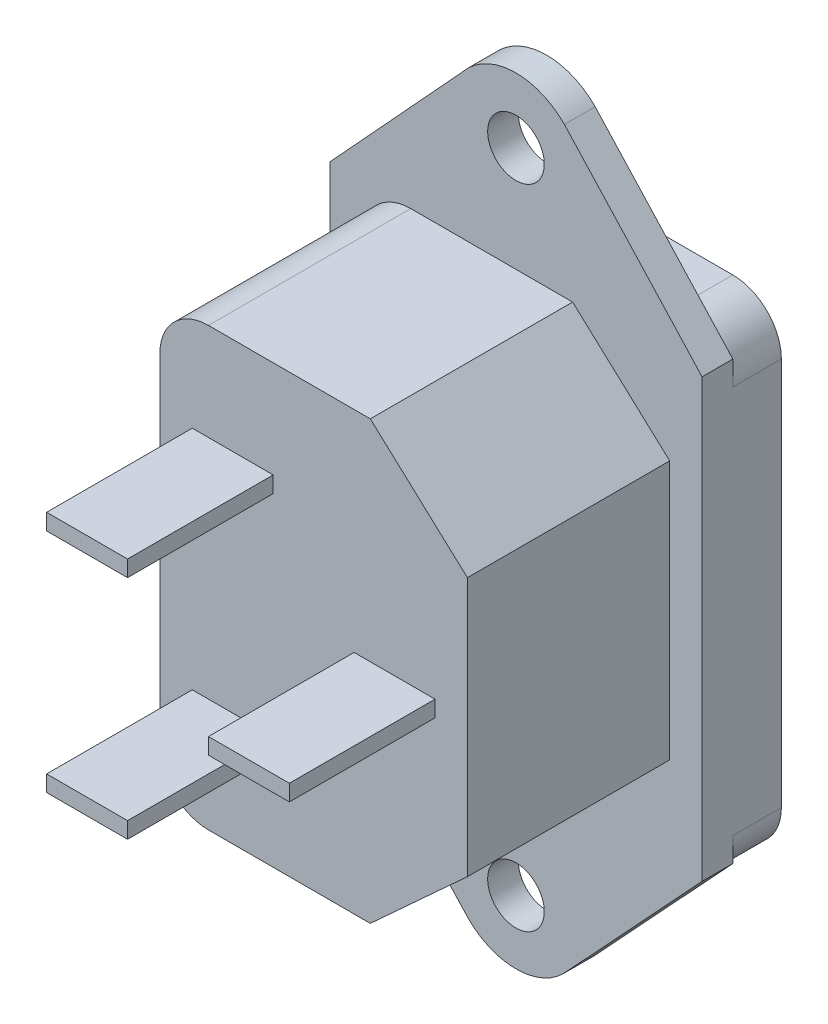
ISO-10303-21;
HEADER;
FILE_DESCRIPTION(('STEP AP214'),'2;1');
FILE_NAME('part.step','',(''),(''),'','','');
FILE_SCHEMA(('AUTOMOTIVE_DESIGN { 1 0 10303 214 1 1 1 1 }'));
ENDSEC;
DATA;
#1=APPLICATION_CONTEXT('core data for automotive mechanical design processes');
#2=APPLICATION_PROTOCOL_DEFINITION('international standard','automotive_design',2000,#1);
#3=PRODUCT_CONTEXT('',#1,'mechanical');
#4=PRODUCT('Part','Part','',(#3));
#5=PRODUCT_RELATED_PRODUCT_CATEGORY('part','',(#4));
#6=PRODUCT_DEFINITION_FORMATION('','',#4);
#7=PRODUCT_DEFINITION_CONTEXT('part definition',#1,'design');
#8=PRODUCT_DEFINITION('design','',#6,#7);
#9=PRODUCT_DEFINITION_SHAPE('','',#8);
#10=(LENGTH_UNIT() NAMED_UNIT(*) SI_UNIT(.MILLI.,.METRE.));
#11=(NAMED_UNIT(*) PLANE_ANGLE_UNIT() SI_UNIT($,.RADIAN.));
#12=(NAMED_UNIT(*) SI_UNIT($,.STERADIAN.) SOLID_ANGLE_UNIT());
#13=UNCERTAINTY_MEASURE_WITH_UNIT(LENGTH_MEASURE(1.E-05),#10,'distance_accuracy_value','');
#14=(GEOMETRIC_REPRESENTATION_CONTEXT(3) GLOBAL_UNCERTAINTY_ASSIGNED_CONTEXT((#13)) GLOBAL_UNIT_ASSIGNED_CONTEXT((#10,
#11,#12)) REPRESENTATION_CONTEXT('',''));
#15=CARTESIAN_POINT('',(0.,0.,0.));
#16=DIRECTION('',(0.,0.,1.));
#17=DIRECTION('',(1.,0.,0.));
#18=AXIS2_PLACEMENT_3D('',#15,#16,#17);
#19=CARTESIAN_POINT('',(-0.00242632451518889,19.8242295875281,0.));
#20=DIRECTION('',(0.,0.,-1.));
#21=DIRECTION('',(-1.,0.,0.));
#22=AXIS2_PLACEMENT_3D('',#19,#20,#21);
#23=PLANE('',#22);
#24=CARTESIAN_POINT('',(0.,20.,0.));
#25=DIRECTION('',(0.,0.,-1.));
#26=DIRECTION('',(-1.,0.,0.));
#27=AXIS2_PLACEMENT_3D('',#24,#25,#26);
#28=CIRCLE('',#27,1.75);
#29=CARTESIAN_POINT('',(-1.75,20.,0.));
#30=VERTEX_POINT('',#29);
#31=EDGE_CURVE('E619',#30,#30,#28,.T.);
#32=ORIENTED_EDGE('',*,*,#31,.F.);
#33=EDGE_LOOP('',(#32));
#34=FACE_BOUND('',#33,.T.);
#35=DIRECTION('',(0.,1.,0.));
#36=VECTOR('',#35,1.);
#37=CARTESIAN_POINT('',(11.5000000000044,13.4999999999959,0.));
#38=LINE('',#37,#36);
#39=CARTESIAN_POINT('',(11.5,12.,0.));
#40=VERTEX_POINT('',#39);
#41=CARTESIAN_POINT('',(11.5000000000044,13.4999999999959,0.));
#42=VERTEX_POINT('',#41);
#43=EDGE_CURVE('E658',#40,#42,#38,.T.);
#44=ORIENTED_EDGE('',*,*,#43,.F.);
#45=CARTESIAN_POINT('',(8.49999999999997,12.,0.));
#46=DIRECTION('',(0.,0.,1.));
#47=DIRECTION('',(1.,0.,0.));
#48=AXIS2_PLACEMENT_3D('',#45,#46,#47);
#49=CIRCLE('',#48,3.00000000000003);
#50=CARTESIAN_POINT('',(8.5,15.,0.));
#51=VERTEX_POINT('',#50);
#52=EDGE_CURVE('E391',#40,#51,#49,.T.);
#53=ORIENTED_EDGE('',*,*,#52,.T.);
#54=DIRECTION('',(-1.,0.,0.));
#55=VECTOR('',#54,1.);
#56=CARTESIAN_POINT('',(8.5,15.,0.));
#57=LINE('',#56,#55);
#58=CARTESIAN_POINT('',(-8.5,15.,0.));
#59=VERTEX_POINT('',#58);
#60=EDGE_CURVE('E444',#51,#59,#57,.T.);
#61=ORIENTED_EDGE('',*,*,#60,.T.);
#62=CARTESIAN_POINT('',(-8.5,12.,0.));
#63=DIRECTION('',(0.,0.,1.));
#64=DIRECTION('',(1.,0.,0.));
#65=AXIS2_PLACEMENT_3D('',#62,#63,#64);
#66=CIRCLE('',#65,3.);
#67=CARTESIAN_POINT('',(-11.5,12.,0.));
#68=VERTEX_POINT('',#67);
#69=EDGE_CURVE('E435',#59,#68,#66,.T.);
#70=ORIENTED_EDGE('',*,*,#69,.T.);
#71=DIRECTION('',(0.,-1.,0.));
#72=VECTOR('',#71,1.);
#73=CARTESIAN_POINT('',(-11.5,-13.5,0.));
#74=LINE('',#73,#72);
#75=CARTESIAN_POINT('',(-11.5,13.5,0.));
#76=VERTEX_POINT('',#75);
#77=EDGE_CURVE('E655',#76,#68,#74,.T.);
#78=ORIENTED_EDGE('',*,*,#77,.F.);
#79=DIRECTION('',(-0.676930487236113,-0.736046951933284,0.));
#80=VECTOR('',#79,1.);
#81=CARTESIAN_POINT('',(-11.5,13.5,0.));
#82=LINE('',#81,#80);
#83=CARTESIAN_POINT('',(-2.92974949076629,22.8186920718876,0.));
#84=VERTEX_POINT('',#83);
#85=EDGE_CURVE('E649',#84,#76,#82,.T.);
#86=ORIENTED_EDGE('',*,*,#85,.F.);
#87=CARTESIAN_POINT('',(-0.00242632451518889,19.8242295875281,0.));
#88=DIRECTION('',(0.,0.,1.));
#89=DIRECTION('',(-1.,0.,0.));
#90=AXIS2_PLACEMENT_3D('',#87,#88,#89);
#91=CIRCLE('',#90,4.18760390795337);
#92=CARTESIAN_POINT('',(2.99203615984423,22.7515527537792,0.));
#93=VERTEX_POINT('',#92);
#94=EDGE_CURVE('E647',#93,#84,#91,.T.);
#95=ORIENTED_EDGE('',*,*,#94,.F.);
#96=DIRECTION('',(-0.676907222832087,0.736068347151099,0.));
#97=VECTOR('',#96,1.);
#98=CARTESIAN_POINT('',(11.5000000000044,13.4999999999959,0.));
#99=LINE('',#98,#97);
#100=EDGE_CURVE('E625',#42,#93,#99,.T.);
#101=ORIENTED_EDGE('',*,*,#100,.F.);
#102=EDGE_LOOP('',(#44,#53,#61,#70,#78,#86,#95,#101));
#103=FACE_BOUND('',#102,.T.);
#104=ADVANCED_FACE('F32',(#34,#103),#23,.T.);
#105=CARTESIAN_POINT('',(0.,-20.,0.));
#106=DIRECTION('',(0.,0.,-1.));
#107=DIRECTION('',(-1.,0.,0.));
#108=AXIS2_PLACEMENT_3D('',#105,#106,#107);
#109=CIRCLE('',#108,1.75);
#110=CARTESIAN_POINT('',(-1.75,-20.,0.));
#111=VERTEX_POINT('',#110);
#112=EDGE_CURVE('E613',#111,#111,#109,.T.);
#113=ORIENTED_EDGE('',*,*,#112,.F.);
#114=EDGE_LOOP('',(#113));
#115=FACE_BOUND('',#114,.T.);
#116=CARTESIAN_POINT('',(-11.5,-12.,0.));
#117=VERTEX_POINT('',#116);
#118=CARTESIAN_POINT('',(-11.5,-13.5,0.));
#119=VERTEX_POINT('',#118);
#120=EDGE_CURVE('E418',#117,#119,#74,.T.);
#121=ORIENTED_EDGE('',*,*,#120,.F.);
#122=CARTESIAN_POINT('',(-8.49999999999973,-11.9999999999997,0.));
#123=DIRECTION('',(0.,0.,1.));
#124=DIRECTION('',(1.,0.,0.));
#125=AXIS2_PLACEMENT_3D('',#122,#123,#124);
#126=CIRCLE('',#125,3.00000000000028);
#127=CARTESIAN_POINT('',(-8.5,-15.,0.));
#128=VERTEX_POINT('',#127);
#129=EDGE_CURVE('E432',#117,#128,#126,.T.);
#130=ORIENTED_EDGE('',*,*,#129,.T.);
#131=DIRECTION('',(-1.,0.,0.));
#132=VECTOR('',#131,1.);
#133=CARTESIAN_POINT('',(8.5,-15.,0.));
#134=LINE('',#133,#132);
#135=CARTESIAN_POINT('',(8.5,-15.,0.));
#136=VERTEX_POINT('',#135);
#137=EDGE_CURVE('E413',#136,#128,#134,.T.);
#138=ORIENTED_EDGE('',*,*,#137,.F.);
#139=CARTESIAN_POINT('',(8.49999999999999,-12.,0.));
#140=DIRECTION('',(0.,0.,1.));
#141=DIRECTION('',(1.,0.,0.));
#142=AXIS2_PLACEMENT_3D('',#139,#140,#141);
#143=CIRCLE('',#142,3.);
#144=CARTESIAN_POINT('',(11.5000000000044,-12.,0.));
#145=VERTEX_POINT('',#144);
#146=EDGE_CURVE('E376',#136,#145,#143,.T.);
#147=ORIENTED_EDGE('',*,*,#146,.T.);
#148=CARTESIAN_POINT('',(11.5000000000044,-13.5000000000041,0.));
#149=VERTEX_POINT('',#148);
#150=EDGE_CURVE('E630',#149,#145,#38,.T.);
#151=ORIENTED_EDGE('',*,*,#150,.F.);
#152=DIRECTION('',(0.680692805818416,0.732568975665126,0.));
#153=VECTOR('',#152,1.);
#154=CARTESIAN_POINT('',(11.5000000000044,-13.5000000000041,0.));
#155=LINE('',#154,#153);
#156=CARTESIAN_POINT('',(2.93067564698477,-22.722399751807,0.));
#157=VERTEX_POINT('',#156);
#158=EDGE_CURVE('E661',#157,#149,#155,.T.);
#159=ORIENTED_EDGE('',*,*,#158,.F.);
#160=CARTESIAN_POINT('',(0.000394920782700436,-19.7922553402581,0.));
#161=DIRECTION('',(0.,0.,1.));
#162=DIRECTION('',(-1.,0.,0.));
#163=AXIS2_PLACEMENT_3D('',#160,#161,#162);
#164=CIRCLE('',#163,4.14394635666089);
#165=CARTESIAN_POINT('',(-2.92974949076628,-22.7225360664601,0.));
#166=VERTEX_POINT('',#165);
#167=EDGE_CURVE('E744',#166,#157,#164,.T.);
#168=ORIENTED_EDGE('',*,*,#167,.F.);
#169=DIRECTION('',(0.680726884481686,-0.732537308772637,0.));
#170=VECTOR('',#169,1.);
#171=CARTESIAN_POINT('',(-11.5,-13.5,0.));
#172=LINE('',#171,#170);
#173=EDGE_CURVE('E652',#119,#166,#172,.T.);
#174=ORIENTED_EDGE('',*,*,#173,.F.);
#175=EDGE_LOOP('',(#121,#130,#138,#147,#151,#159,#168,#174));
#176=FACE_BOUND('',#175,.T.);
#177=ADVANCED_FACE('F741',(#115,#176),#23,.T.);
#178=CARTESIAN_POINT('',(-6.49999999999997,-10.5,14.4));
#179=DIRECTION('',(0.,0.,-1.));
#180=DIRECTION('',(-1.,0.,0.));
#181=AXIS2_PLACEMENT_3D('',#178,#179,#180);
#182=PLANE('',#181);
#183=DIRECTION('',(0.,-1.,0.));
#184=VECTOR('',#183,1.);
#185=CARTESIAN_POINT('',(-7.5,-6.5,14.4));
#186=LINE('',#185,#184);
#187=CARTESIAN_POINT('',(-7.5,-6.5,14.4));
#188=VERTEX_POINT('',#187);
#189=CARTESIAN_POINT('',(-7.5,-7.5,14.4));
#190=VERTEX_POINT('',#189);
#191=EDGE_CURVE('E465',#188,#190,#186,.T.);
#192=ORIENTED_EDGE('',*,*,#191,.F.);
#193=DIRECTION('',(1.,0.,0.));
#194=VECTOR('',#193,1.);
#195=CARTESIAN_POINT('',(-7.5,-6.5,14.4));
#196=LINE('',#195,#194);
#197=CARTESIAN_POINT('',(-2.5,-6.5,14.4));
#198=VERTEX_POINT('',#197);
#199=EDGE_CURVE('E473',#188,#198,#196,.T.);
#200=ORIENTED_EDGE('',*,*,#199,.T.);
#201=DIRECTION('',(0.,-1.,0.));
#202=VECTOR('',#201,1.);
#203=CARTESIAN_POINT('',(-2.5,-6.5,14.4));
#204=LINE('',#203,#202);
#205=CARTESIAN_POINT('',(-2.5,-7.5,14.4));
#206=VERTEX_POINT('',#205);
#207=EDGE_CURVE('E470',#198,#206,#204,.T.);
#208=ORIENTED_EDGE('',*,*,#207,.T.);
#209=DIRECTION('',(1.,0.,0.));
#210=VECTOR('',#209,1.);
#211=CARTESIAN_POINT('',(-7.5,-7.5,14.4));
#212=LINE('',#211,#210);
#213=EDGE_CURVE('E467',#190,#206,#212,.T.);
#214=ORIENTED_EDGE('',*,*,#213,.F.);
#215=EDGE_LOOP('',(#192,#200,#208,#214));
#216=FACE_BOUND('',#215,.T.);
#217=DIRECTION('',(0.,-1.,0.));
#218=VECTOR('',#217,1.);
#219=CARTESIAN_POINT('',(-7.5,7.5,14.4));
#220=LINE('',#219,#218);
#221=CARTESIAN_POINT('',(-7.5,7.5,14.4));
#222=VERTEX_POINT('',#221);
#223=CARTESIAN_POINT('',(-7.5,6.5,14.4));
#224=VERTEX_POINT('',#223);
#225=EDGE_CURVE('E507',#222,#224,#220,.T.);
#226=ORIENTED_EDGE('',*,*,#225,.F.);
#227=DIRECTION('',(1.,0.,0.));
#228=VECTOR('',#227,1.);
#229=CARTESIAN_POINT('',(-7.5,7.5,14.4));
#230=LINE('',#229,#228);
#231=CARTESIAN_POINT('',(-2.5,7.5,14.4));
#232=VERTEX_POINT('',#231);
#233=EDGE_CURVE('E521',#222,#232,#230,.T.);
#234=ORIENTED_EDGE('',*,*,#233,.T.);
#235=DIRECTION('',(0.,-1.,0.));
#236=VECTOR('',#235,1.);
#237=CARTESIAN_POINT('',(-2.5,7.5,14.4));
#238=LINE('',#237,#236);
#239=CARTESIAN_POINT('',(-2.5,6.5,14.4));
#240=VERTEX_POINT('',#239);
#241=EDGE_CURVE('E535',#232,#240,#238,.T.);
#242=ORIENTED_EDGE('',*,*,#241,.T.);
#243=DIRECTION('',(1.,0.,0.));
#244=VECTOR('',#243,1.);
#245=CARTESIAN_POINT('',(-7.5,6.5,14.4));
#246=LINE('',#245,#244);
#247=EDGE_CURVE('E532',#224,#240,#246,.T.);
#248=ORIENTED_EDGE('',*,*,#247,.F.);
#249=EDGE_LOOP('',(#226,#234,#242,#248));
#250=FACE_BOUND('',#249,.T.);
#251=CARTESIAN_POINT('',(-6.49999999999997,-10.5,14.4));
#252=DIRECTION('',(0.,0.,1.));
#253=DIRECTION('',(-1.,0.,0.));
#254=AXIS2_PLACEMENT_3D('',#251,#252,#253);
#255=CIRCLE('',#254,3.00000000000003);
#256=CARTESIAN_POINT('',(-9.5,-10.5,14.4));
#257=VERTEX_POINT('',#256);
#258=CARTESIAN_POINT('',(-6.5,-13.5,14.4));
#259=VERTEX_POINT('',#258);
#260=EDGE_CURVE('E549',#257,#259,#255,.T.);
#261=ORIENTED_EDGE('',*,*,#260,.T.);
#262=DIRECTION('',(1.,0.,0.));
#263=VECTOR('',#262,1.);
#264=CARTESIAN_POINT('',(3.5,-13.5,14.4));
#265=LINE('',#264,#263);
#266=CARTESIAN_POINT('',(3.5,-13.5,14.4));
#267=VERTEX_POINT('',#266);
#268=EDGE_CURVE('E552',#259,#267,#265,.T.);
#269=ORIENTED_EDGE('',*,*,#268,.T.);
#270=DIRECTION('',(0.737154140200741,0.675724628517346,0.));
#271=VECTOR('',#270,1.);
#272=CARTESIAN_POINT('',(3.5,-13.5,14.4));
#273=LINE('',#272,#271);
#274=CARTESIAN_POINT('',(9.5,-8.,14.4));
#275=VERTEX_POINT('',#274);
#276=EDGE_CURVE('E555',#267,#275,#273,.T.);
#277=ORIENTED_EDGE('',*,*,#276,.T.);
#278=DIRECTION('',(0.,1.,0.));
#279=VECTOR('',#278,1.);
#280=CARTESIAN_POINT('',(9.5,8.,14.4));
#281=LINE('',#280,#279);
#282=CARTESIAN_POINT('',(9.5,8.,14.4));
#283=VERTEX_POINT('',#282);
#284=EDGE_CURVE('E557',#275,#283,#281,.T.);
#285=ORIENTED_EDGE('',*,*,#284,.T.);
#286=DIRECTION('',(-0.737154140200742,0.675724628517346,0.));
#287=VECTOR('',#286,1.);
#288=CARTESIAN_POINT('',(3.5,13.5,14.4));
#289=LINE('',#288,#287);
#290=CARTESIAN_POINT('',(3.5,13.5,14.4));
#291=VERTEX_POINT('',#290);
#292=EDGE_CURVE('E559',#283,#291,#289,.T.);
#293=ORIENTED_EDGE('',*,*,#292,.T.);
#294=DIRECTION('',(-1.,0.,0.));
#295=VECTOR('',#294,1.);
#296=CARTESIAN_POINT('',(3.5,13.5,14.4));
#297=LINE('',#296,#295);
#298=CARTESIAN_POINT('',(-6.5,13.5,14.4));
#299=VERTEX_POINT('',#298);
#300=EDGE_CURVE('E561',#291,#299,#297,.T.);
#301=ORIENTED_EDGE('',*,*,#300,.T.);
#302=CARTESIAN_POINT('',(-6.49999999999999,10.5,14.4));
#303=DIRECTION('',(0.,0.,1.));
#304=DIRECTION('',(-1.,0.,0.));
#305=AXIS2_PLACEMENT_3D('',#302,#303,#304);
#306=CIRCLE('',#305,3.00000000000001);
#307=CARTESIAN_POINT('',(-9.5,10.5,14.4));
#308=VERTEX_POINT('',#307);
#309=EDGE_CURVE('E563',#299,#308,#306,.T.);
#310=ORIENTED_EDGE('',*,*,#309,.T.);
#311=DIRECTION('',(0.,-1.,0.));
#312=VECTOR('',#311,1.);
#313=CARTESIAN_POINT('',(-9.5,-10.5,14.4));
#314=LINE('',#313,#312);
#315=EDGE_CURVE('E565',#308,#257,#314,.T.);
#316=ORIENTED_EDGE('',*,*,#315,.T.);
#317=EDGE_LOOP('',(#261,#269,#277,#285,#293,#301,#310,#316));
#318=FACE_BOUND('',#317,.T.);
#319=DIRECTION('',(1.,0.,0.));
#320=VECTOR('',#319,1.);
#321=CARTESIAN_POINT('',(2.5,-0.5,14.4));
#322=LINE('',#321,#320);
#323=CARTESIAN_POINT('',(2.5,-0.5,14.4));
#324=VERTEX_POINT('',#323);
#325=CARTESIAN_POINT('',(7.5,-0.5,14.4));
#326=VERTEX_POINT('',#325);
#327=EDGE_CURVE('E504',#324,#326,#322,.T.);
#328=ORIENTED_EDGE('',*,*,#327,.F.);
#329=DIRECTION('',(0.,1.,0.));
#330=VECTOR('',#329,1.);
#331=CARTESIAN_POINT('',(2.5,-0.5,14.4));
#332=LINE('',#331,#330);
#333=CARTESIAN_POINT('',(2.5,0.5,14.4));
#334=VERTEX_POINT('',#333);
#335=EDGE_CURVE('E494',#324,#334,#332,.T.);
#336=ORIENTED_EDGE('',*,*,#335,.T.);
#337=DIRECTION('',(1.,0.,0.));
#338=VECTOR('',#337,1.);
#339=CARTESIAN_POINT('',(2.5,0.5,14.4));
#340=LINE('',#339,#338);
#341=CARTESIAN_POINT('',(7.5,0.5,14.4));
#342=VERTEX_POINT('',#341);
#343=EDGE_CURVE('E497',#334,#342,#340,.T.);
#344=ORIENTED_EDGE('',*,*,#343,.T.);
#345=DIRECTION('',(0.,1.,0.));
#346=VECTOR('',#345,1.);
#347=CARTESIAN_POINT('',(7.5,-0.5,14.4));
#348=LINE('',#347,#346);
#349=EDGE_CURVE('E501',#326,#342,#348,.T.);
#350=ORIENTED_EDGE('',*,*,#349,.F.);
#351=EDGE_LOOP('',(#328,#336,#344,#350));
#352=FACE_BOUND('',#351,.T.);
#353=ADVANCED_FACE('F773',(#216,#250,#318,#352),#182,.F.);
#354=CARTESIAN_POINT('',(-0.00242632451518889,19.8242295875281,1.9));
#355=DIRECTION('',(0.,0.,-1.));
#356=DIRECTION('',(-1.,0.,0.));
#357=AXIS2_PLACEMENT_3D('',#354,#355,#356);
#358=PLANE('',#357);
#359=DIRECTION('',(-0.676907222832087,0.736068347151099,0.));
#360=VECTOR('',#359,1.);
#361=CARTESIAN_POINT('',(11.5000000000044,13.4999999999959,1.9));
#362=LINE('',#361,#360);
#363=CARTESIAN_POINT('',(11.5000000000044,13.4999999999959,1.9));
#364=VERTEX_POINT('',#363);
#365=CARTESIAN_POINT('',(2.99203615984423,22.7515527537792,1.9));
#366=VERTEX_POINT('',#365);
#367=EDGE_CURVE('E626',#364,#366,#362,.T.);
#368=ORIENTED_EDGE('',*,*,#367,.T.);
#369=CARTESIAN_POINT('',(-0.00242632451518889,19.8242295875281,1.9));
#370=DIRECTION('',(0.,0.,1.));
#371=DIRECTION('',(-1.,0.,0.));
#372=AXIS2_PLACEMENT_3D('',#369,#370,#371);
#373=CIRCLE('',#372,4.18760390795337);
#374=CARTESIAN_POINT('',(-2.92974949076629,22.8186920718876,1.9));
#375=VERTEX_POINT('',#374);
#376=EDGE_CURVE('E629',#366,#375,#373,.T.);
#377=ORIENTED_EDGE('',*,*,#376,.T.);
#378=DIRECTION('',(-0.676930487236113,-0.736046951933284,0.));
#379=VECTOR('',#378,1.);
#380=CARTESIAN_POINT('',(-11.5,13.5,1.9));
#381=LINE('',#380,#379);
#382=CARTESIAN_POINT('',(-11.5,13.5,1.9));
#383=VERTEX_POINT('',#382);
#384=EDGE_CURVE('E632',#375,#383,#381,.T.);
#385=ORIENTED_EDGE('',*,*,#384,.T.);
#386=DIRECTION('',(0.,-1.,0.));
#387=VECTOR('',#386,1.);
#388=CARTESIAN_POINT('',(-11.5,-13.5,1.9));
#389=LINE('',#388,#387);
#390=CARTESIAN_POINT('',(-11.5,-13.5,1.9));
#391=VERTEX_POINT('',#390);
#392=EDGE_CURVE('E634',#383,#391,#389,.T.);
#393=ORIENTED_EDGE('',*,*,#392,.T.);
#394=DIRECTION('',(0.680726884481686,-0.732537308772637,0.));
#395=VECTOR('',#394,1.);
#396=CARTESIAN_POINT('',(-11.5,-13.5,1.9));
#397=LINE('',#396,#395);
#398=CARTESIAN_POINT('',(-2.92974949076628,-22.7225360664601,1.9));
#399=VERTEX_POINT('',#398);
#400=EDGE_CURVE('E636',#391,#399,#397,.T.);
#401=ORIENTED_EDGE('',*,*,#400,.T.);
#402=CARTESIAN_POINT('',(0.000394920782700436,-19.7922553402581,1.9));
#403=DIRECTION('',(0.,0.,1.));
#404=DIRECTION('',(-1.,0.,0.));
#405=AXIS2_PLACEMENT_3D('',#402,#403,#404);
#406=CIRCLE('',#405,4.14394635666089);
#407=CARTESIAN_POINT('',(2.93067564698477,-22.722399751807,1.9));
#408=VERTEX_POINT('',#407);
#409=EDGE_CURVE('E638',#399,#408,#406,.T.);
#410=ORIENTED_EDGE('',*,*,#409,.T.);
#411=DIRECTION('',(0.680692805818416,0.732568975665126,0.));
#412=VECTOR('',#411,1.);
#413=CARTESIAN_POINT('',(11.5000000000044,-13.5000000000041,1.9));
#414=LINE('',#413,#412);
#415=CARTESIAN_POINT('',(11.5000000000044,-13.5000000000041,1.9));
#416=VERTEX_POINT('',#415);
#417=EDGE_CURVE('E640',#408,#416,#414,.T.);
#418=ORIENTED_EDGE('',*,*,#417,.T.);
#419=DIRECTION('',(0.,1.,0.));
#420=VECTOR('',#419,1.);
#421=CARTESIAN_POINT('',(11.5000000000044,13.4999999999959,1.9));
#422=LINE('',#421,#420);
#423=EDGE_CURVE('E642',#416,#364,#422,.T.);
#424=ORIENTED_EDGE('',*,*,#423,.T.);
#425=EDGE_LOOP('',(#368,#377,#385,#393,#401,#410,#418,#424));
#426=FACE_BOUND('',#425,.T.);
#427=CARTESIAN_POINT('',(0.,20.,1.9));
#428=DIRECTION('',(0.,0.,-1.));
#429=DIRECTION('',(-1.,0.,0.));
#430=AXIS2_PLACEMENT_3D('',#427,#428,#429);
#431=CIRCLE('',#430,1.75);
#432=CARTESIAN_POINT('',(-1.75,20.,1.9));
#433=VERTEX_POINT('',#432);
#434=EDGE_CURVE('E622',#433,#433,#431,.F.);
#435=ORIENTED_EDGE('',*,*,#434,.F.);
#436=EDGE_LOOP('',(#435));
#437=FACE_BOUND('',#436,.T.);
#438=CARTESIAN_POINT('',(0.,-20.,1.9));
#439=DIRECTION('',(0.,0.,-1.));
#440=DIRECTION('',(-1.,0.,0.));
#441=AXIS2_PLACEMENT_3D('',#438,#439,#440);
#442=CIRCLE('',#441,1.75);
#443=CARTESIAN_POINT('',(-1.75,-20.,1.9));
#444=VERTEX_POINT('',#443);
#445=EDGE_CURVE('E616',#444,#444,#442,.F.);
#446=ORIENTED_EDGE('',*,*,#445,.F.);
#447=EDGE_LOOP('',(#446));
#448=FACE_BOUND('',#447,.T.);
#449=CARTESIAN_POINT('',(-6.49999999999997,-10.5,1.9));
#450=DIRECTION('',(0.,0.,1.));
#451=DIRECTION('',(-1.,0.,0.));
#452=AXIS2_PLACEMENT_3D('',#449,#450,#451);
#453=CIRCLE('',#452,3.00000000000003);
#454=CARTESIAN_POINT('',(-9.5,-10.5,1.9));
#455=VERTEX_POINT('',#454);
#456=CARTESIAN_POINT('',(-6.5,-13.5,1.9));
#457=VERTEX_POINT('',#456);
#458=EDGE_CURVE('E548',#455,#457,#453,.T.);
#459=ORIENTED_EDGE('',*,*,#458,.F.);
#460=DIRECTION('',(0.,-1.,0.));
#461=VECTOR('',#460,1.);
#462=CARTESIAN_POINT('',(-9.5,-10.5,1.9));
#463=LINE('',#462,#461);
#464=CARTESIAN_POINT('',(-9.5,10.5,1.9));
#465=VERTEX_POINT('',#464);
#466=EDGE_CURVE('E553',#465,#455,#463,.T.);
#467=ORIENTED_EDGE('',*,*,#466,.F.);
#468=CARTESIAN_POINT('',(-6.49999999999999,10.5,1.9));
#469=DIRECTION('',(0.,0.,1.));
#470=DIRECTION('',(-1.,0.,0.));
#471=AXIS2_PLACEMENT_3D('',#468,#469,#470);
#472=CIRCLE('',#471,3.00000000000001);
#473=CARTESIAN_POINT('',(-6.5,13.5,1.9));
#474=VERTEX_POINT('',#473);
#475=EDGE_CURVE('E585',#474,#465,#472,.T.);
#476=ORIENTED_EDGE('',*,*,#475,.F.);
#477=DIRECTION('',(-1.,0.,0.));
#478=VECTOR('',#477,1.);
#479=CARTESIAN_POINT('',(3.5,13.5,1.9));
#480=LINE('',#479,#478);
#481=CARTESIAN_POINT('',(3.5,13.5,1.9));
#482=VERTEX_POINT('',#481);
#483=EDGE_CURVE('E582',#482,#474,#480,.T.);
#484=ORIENTED_EDGE('',*,*,#483,.F.);
#485=DIRECTION('',(-0.737154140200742,0.675724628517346,0.));
#486=VECTOR('',#485,1.);
#487=CARTESIAN_POINT('',(3.5,13.5,1.9));
#488=LINE('',#487,#486);
#489=CARTESIAN_POINT('',(9.5,8.,1.9));
#490=VERTEX_POINT('',#489);
#491=EDGE_CURVE('E579',#490,#482,#488,.T.);
#492=ORIENTED_EDGE('',*,*,#491,.F.);
#493=DIRECTION('',(0.,1.,0.));
#494=VECTOR('',#493,1.);
#495=CARTESIAN_POINT('',(9.5,8.,1.9));
#496=LINE('',#495,#494);
#497=CARTESIAN_POINT('',(9.5,-8.,1.9));
#498=VERTEX_POINT('',#497);
#499=EDGE_CURVE('E576',#498,#490,#496,.T.);
#500=ORIENTED_EDGE('',*,*,#499,.F.);
#501=DIRECTION('',(0.737154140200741,0.675724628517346,0.));
#502=VECTOR('',#501,1.);
#503=CARTESIAN_POINT('',(3.5,-13.5,1.9));
#504=LINE('',#503,#502);
#505=CARTESIAN_POINT('',(3.5,-13.5,1.9));
#506=VERTEX_POINT('',#505);
#507=EDGE_CURVE('E573',#506,#498,#504,.T.);
#508=ORIENTED_EDGE('',*,*,#507,.F.);
#509=DIRECTION('',(1.,0.,0.));
#510=VECTOR('',#509,1.);
#511=CARTESIAN_POINT('',(3.5,-13.5,1.9));
#512=LINE('',#511,#510);
#513=EDGE_CURVE('E570',#457,#506,#512,.T.);
#514=ORIENTED_EDGE('',*,*,#513,.F.);
#515=EDGE_LOOP('',(#459,#467,#476,#484,#492,#500,#508,#514));
#516=FACE_BOUND('',#515,.T.);
#517=ADVANCED_FACE('F703',(#426,#437,#448,#516),#358,.F.);
#518=CARTESIAN_POINT('',(11.5000000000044,13.4999999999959,1.9));
#519=DIRECTION('',(-0.736068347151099,-0.676907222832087,0.));
#520=DIRECTION('',(0.676907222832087,-0.736068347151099,0.));
#521=AXIS2_PLACEMENT_3D('',#518,#519,#520);
#522=PLANE('',#521);
#523=ORIENTED_EDGE('',*,*,#100,.T.);
#524=DIRECTION('',(0.,0.,-1.));
#525=VECTOR('',#524,1.);
#526=CARTESIAN_POINT('',(2.99203615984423,22.7515527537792,1.9));
#527=LINE('',#526,#525);
#528=EDGE_CURVE('E11',#366,#93,#527,.T.);
#529=ORIENTED_EDGE('',*,*,#528,.F.);
#530=ORIENTED_EDGE('',*,*,#367,.F.);
#531=DIRECTION('',(0.,0.,-1.));
#532=VECTOR('',#531,1.);
#533=CARTESIAN_POINT('',(11.5000000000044,13.4999999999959,1.9));
#534=LINE('',#533,#532);
#535=EDGE_CURVE('E644',#364,#42,#534,.T.);
#536=ORIENTED_EDGE('',*,*,#535,.T.);
#537=EDGE_LOOP('',(#523,#529,#530,#536));
#538=FACE_BOUND('',#537,.T.);
#539=ADVANCED_FACE('F34',(#538),#522,.F.);
#540=CARTESIAN_POINT('',(-0.00242632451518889,19.8242295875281,1.9));
#541=DIRECTION('',(0.,0.,-1.));
#542=DIRECTION('',(-1.,0.,0.));
#543=AXIS2_PLACEMENT_3D('',#540,#541,#542);
#544=CYLINDRICAL_SURFACE('',#543,4.18760390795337);
#545=ORIENTED_EDGE('',*,*,#94,.T.);
#546=DIRECTION('',(0.,0.,-1.));
#547=VECTOR('',#546,1.);
#548=CARTESIAN_POINT('',(-2.92974949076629,22.8186920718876,1.9));
#549=LINE('',#548,#547);
#550=EDGE_CURVE('E41',#375,#84,#549,.T.);
#551=ORIENTED_EDGE('',*,*,#550,.F.);
#552=ORIENTED_EDGE('',*,*,#376,.F.);
#553=ORIENTED_EDGE('',*,*,#528,.T.);
#554=EDGE_LOOP('',(#545,#551,#552,#553));
#555=FACE_BOUND('',#554,.T.);
#556=ADVANCED_FACE('F708',(#555),#544,.T.);
#557=CARTESIAN_POINT('',(-11.5,13.5,1.9));
#558=DIRECTION('',(0.736046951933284,-0.676930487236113,0.));
#559=DIRECTION('',(0.676930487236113,0.736046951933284,0.));
#560=AXIS2_PLACEMENT_3D('',#557,#558,#559);
#561=PLANE('',#560);
#562=ORIENTED_EDGE('',*,*,#85,.T.);
#563=DIRECTION('',(0.,0.,-1.));
#564=VECTOR('',#563,1.);
#565=CARTESIAN_POINT('',(-11.5,13.5,1.9));
#566=LINE('',#565,#564);
#567=EDGE_CURVE('E680',#383,#76,#566,.T.);
#568=ORIENTED_EDGE('',*,*,#567,.F.);
#569=ORIENTED_EDGE('',*,*,#384,.F.);
#570=ORIENTED_EDGE('',*,*,#550,.T.);
#571=EDGE_LOOP('',(#562,#568,#569,#570));
#572=FACE_BOUND('',#571,.T.);
#573=ADVANCED_FACE('F688',(#572),#561,.F.);
#574=CARTESIAN_POINT('',(-11.5,-13.5,1.9));
#575=DIRECTION('',(1.,0.,0.));
#576=DIRECTION('',(0.,0.,-1.));
#577=AXIS2_PLACEMENT_3D('',#574,#575,#576);
#578=PLANE('',#577);
#579=ORIENTED_EDGE('',*,*,#77,.T.);
#580=DIRECTION('',(0.,0.,1.));
#581=VECTOR('',#580,1.);
#582=CARTESIAN_POINT('',(-11.5,12.,-3.));
#583=LINE('',#582,#581);
#584=CARTESIAN_POINT('',(-11.5,12.,-3.));
#585=VERTEX_POINT('',#584);
#586=EDGE_CURVE('E429',#585,#68,#583,.T.);
#587=ORIENTED_EDGE('',*,*,#586,.F.);
#588=DIRECTION('',(0.,-1.,0.));
#589=VECTOR('',#588,1.);
#590=CARTESIAN_POINT('',(-11.5,12.,-3.));
#591=LINE('',#590,#589);
#592=CARTESIAN_POINT('',(-11.5,-12.,-3.));
#593=VERTEX_POINT('',#592);
#594=EDGE_CURVE('E398',#585,#593,#591,.T.);
#595=ORIENTED_EDGE('',*,*,#594,.T.);
#596=DIRECTION('',(0.,0.,1.));
#597=VECTOR('',#596,1.);
#598=CARTESIAN_POINT('',(-11.5,-12.,-3.));
#599=LINE('',#598,#597);
#600=EDGE_CURVE('E426',#593,#117,#599,.T.);
#601=ORIENTED_EDGE('',*,*,#600,.T.);
#602=ORIENTED_EDGE('',*,*,#120,.T.);
#603=DIRECTION('',(0.,0.,-1.));
#604=VECTOR('',#603,1.);
#605=CARTESIAN_POINT('',(-11.5,-13.5,1.9));
#606=LINE('',#605,#604);
#607=EDGE_CURVE('E677',#391,#119,#606,.T.);
#608=ORIENTED_EDGE('',*,*,#607,.F.);
#609=ORIENTED_EDGE('',*,*,#392,.F.);
#610=ORIENTED_EDGE('',*,*,#567,.T.);
#611=EDGE_LOOP('',(#579,#587,#595,#601,#602,#608,#609,#610));
#612=FACE_BOUND('',#611,.T.);
#613=ADVANCED_FACE('F697',(#612),#578,.F.);
#614=CARTESIAN_POINT('',(-11.5,-13.5,1.9));
#615=DIRECTION('',(0.732537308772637,0.680726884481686,0.));
#616=DIRECTION('',(-0.680726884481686,0.732537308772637,0.));
#617=AXIS2_PLACEMENT_3D('',#614,#615,#616);
#618=PLANE('',#617);
#619=ORIENTED_EDGE('',*,*,#173,.T.);
#620=DIRECTION('',(0.,0.,-1.));
#621=VECTOR('',#620,1.);
#622=CARTESIAN_POINT('',(-2.92974949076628,-22.7225360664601,1.9));
#623=LINE('',#622,#621);
#624=EDGE_CURVE('E674',#399,#166,#623,.T.);
#625=ORIENTED_EDGE('',*,*,#624,.F.);
#626=ORIENTED_EDGE('',*,*,#400,.F.);
#627=ORIENTED_EDGE('',*,*,#607,.T.);
#628=EDGE_LOOP('',(#619,#625,#626,#627));
#629=FACE_BOUND('',#628,.T.);
#630=ADVANCED_FACE('F787',(#629),#618,.F.);
#631=CARTESIAN_POINT('',(0.000394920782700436,-19.7922553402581,1.9));
#632=DIRECTION('',(0.,0.,-1.));
#633=DIRECTION('',(-1.,0.,0.));
#634=AXIS2_PLACEMENT_3D('',#631,#632,#633);
#635=CYLINDRICAL_SURFACE('',#634,4.14394635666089);
#636=ORIENTED_EDGE('',*,*,#167,.T.);
#637=DIRECTION('',(0.,0.,-1.));
#638=VECTOR('',#637,1.);
#639=CARTESIAN_POINT('',(2.93067564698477,-22.722399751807,1.9));
#640=LINE('',#639,#638);
#641=EDGE_CURVE('E671',#408,#157,#640,.T.);
#642=ORIENTED_EDGE('',*,*,#641,.F.);
#643=ORIENTED_EDGE('',*,*,#409,.F.);
#644=ORIENTED_EDGE('',*,*,#624,.T.);
#645=EDGE_LOOP('',(#636,#642,#643,#644));
#646=FACE_BOUND('',#645,.T.);
#647=ADVANCED_FACE('F784',(#646),#635,.T.);
#648=CARTESIAN_POINT('',(11.5000000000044,-13.5000000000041,1.9));
#649=DIRECTION('',(-0.732568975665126,0.680692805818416,0.));
#650=DIRECTION('',(-0.680692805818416,-0.732568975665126,0.));
#651=AXIS2_PLACEMENT_3D('',#648,#649,#650);
#652=PLANE('',#651);
#653=ORIENTED_EDGE('',*,*,#158,.T.);
#654=DIRECTION('',(0.,0.,-1.));
#655=VECTOR('',#654,1.);
#656=CARTESIAN_POINT('',(11.5000000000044,-13.5000000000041,1.9));
#657=LINE('',#656,#655);
#658=EDGE_CURVE('E668',#416,#149,#657,.T.);
#659=ORIENTED_EDGE('',*,*,#658,.F.);
#660=ORIENTED_EDGE('',*,*,#417,.F.);
#661=ORIENTED_EDGE('',*,*,#641,.T.);
#662=EDGE_LOOP('',(#653,#659,#660,#661));
#663=FACE_BOUND('',#662,.T.);
#664=ADVANCED_FACE('F750',(#663),#652,.F.);
#665=CARTESIAN_POINT('',(11.5000000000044,13.4999999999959,1.9));
#666=DIRECTION('',(-1.,0.,0.));
#667=DIRECTION('',(0.,-1.,0.));
#668=AXIS2_PLACEMENT_3D('',#665,#666,#667);
#669=PLANE('',#668);
#670=ORIENTED_EDGE('',*,*,#150,.T.);
#671=DIRECTION('',(0.,0.,1.));
#672=VECTOR('',#671,1.);
#673=CARTESIAN_POINT('',(11.5,-12.,-3.));
#674=LINE('',#673,#672);
#675=CARTESIAN_POINT('',(11.5,-12.,-3.));
#676=VERTEX_POINT('',#675);
#677=EDGE_CURVE('E57',#676,#145,#674,.T.);
#678=ORIENTED_EDGE('',*,*,#677,.F.);
#679=DIRECTION('',(0.,-1.,0.));
#680=VECTOR('',#679,1.);
#681=CARTESIAN_POINT('',(11.5,12.,-3.));
#682=LINE('',#681,#680);
#683=CARTESIAN_POINT('',(11.5,12.,-3.));
#684=VERTEX_POINT('',#683);
#685=EDGE_CURVE('E388',#684,#676,#682,.T.);
#686=ORIENTED_EDGE('',*,*,#685,.F.);
#687=DIRECTION('',(0.,0.,1.));
#688=VECTOR('',#687,1.);
#689=CARTESIAN_POINT('',(11.5,12.,-3.));
#690=LINE('',#689,#688);
#691=EDGE_CURVE('E410',#684,#40,#690,.T.);
#692=ORIENTED_EDGE('',*,*,#691,.T.);
#693=ORIENTED_EDGE('',*,*,#43,.T.);
#694=ORIENTED_EDGE('',*,*,#535,.F.);
#695=ORIENTED_EDGE('',*,*,#423,.F.);
#696=ORIENTED_EDGE('',*,*,#658,.T.);
#697=EDGE_LOOP('',(#670,#678,#686,#692,#693,#694,#695,#696));
#698=FACE_BOUND('',#697,.T.);
#699=ADVANCED_FACE('F715',(#698),#669,.F.);
#700=CARTESIAN_POINT('',(0.,20.,6.84974746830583));
#701=DIRECTION('',(0.,0.,-1.));
#702=DIRECTION('',(-1.,0.,0.));
#703=AXIS2_PLACEMENT_3D('',#700,#701,#702);
#704=CYLINDRICAL_SURFACE('',#703,1.75);
#705=ORIENTED_EDGE('',*,*,#434,.T.);
#706=EDGE_LOOP('',(#705));
#707=FACE_BOUND('',#706,.T.);
#708=ORIENTED_EDGE('',*,*,#31,.T.);
#709=EDGE_LOOP('',(#708));
#710=FACE_BOUND('',#709,.T.);
#711=ADVANCED_FACE('F781',(#707,#710),#704,.F.);
#712=CARTESIAN_POINT('',(0.,-20.,6.84974746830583));
#713=DIRECTION('',(0.,0.,-1.));
#714=DIRECTION('',(-1.,0.,0.));
#715=AXIS2_PLACEMENT_3D('',#712,#713,#714);
#716=CYLINDRICAL_SURFACE('',#715,1.75);
#717=ORIENTED_EDGE('',*,*,#445,.T.);
#718=EDGE_LOOP('',(#717));
#719=FACE_BOUND('',#718,.T.);
#720=ORIENTED_EDGE('',*,*,#112,.T.);
#721=EDGE_LOOP('',(#720));
#722=FACE_BOUND('',#721,.T.);
#723=ADVANCED_FACE('F844',(#719,#722),#716,.F.);
#724=CARTESIAN_POINT('',(-6.49999999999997,-10.5,14.4));
#725=DIRECTION('',(0.,0.,-1.));
#726=DIRECTION('',(-1.,0.,0.));
#727=AXIS2_PLACEMENT_3D('',#724,#725,#726);
#728=CYLINDRICAL_SURFACE('',#727,3.00000000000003);
#729=ORIENTED_EDGE('',*,*,#458,.T.);
#730=DIRECTION('',(0.,0.,-1.));
#731=VECTOR('',#730,1.);
#732=CARTESIAN_POINT('',(-6.5,-13.5,14.4));
#733=LINE('',#732,#731);
#734=EDGE_CURVE('E610',#259,#457,#733,.T.);
#735=ORIENTED_EDGE('',*,*,#734,.F.);
#736=ORIENTED_EDGE('',*,*,#260,.F.);
#737=DIRECTION('',(0.,0.,-1.));
#738=VECTOR('',#737,1.);
#739=CARTESIAN_POINT('',(-9.5,-10.5,14.4));
#740=LINE('',#739,#738);
#741=EDGE_CURVE('E567',#257,#455,#740,.T.);
#742=ORIENTED_EDGE('',*,*,#741,.T.);
#743=EDGE_LOOP('',(#729,#735,#736,#742));
#744=FACE_BOUND('',#743,.T.);
#745=ADVANCED_FACE('F840',(#744),#728,.T.);
#746=CARTESIAN_POINT('',(3.5,-13.5,14.4));
#747=DIRECTION('',(0.,1.,0.));
#748=DIRECTION('',(-1.,0.,0.));
#749=AXIS2_PLACEMENT_3D('',#746,#747,#748);
#750=PLANE('',#749);
#751=ORIENTED_EDGE('',*,*,#513,.T.);
#752=DIRECTION('',(0.,0.,-1.));
#753=VECTOR('',#752,1.);
#754=CARTESIAN_POINT('',(3.5,-13.5,14.4));
#755=LINE('',#754,#753);
#756=EDGE_CURVE('E607',#267,#506,#755,.T.);
#757=ORIENTED_EDGE('',*,*,#756,.F.);
#758=ORIENTED_EDGE('',*,*,#268,.F.);
#759=ORIENTED_EDGE('',*,*,#734,.T.);
#760=EDGE_LOOP('',(#751,#757,#758,#759));
#761=FACE_BOUND('',#760,.T.);
#762=ADVANCED_FACE('F836',(#761),#750,.F.);
#763=CARTESIAN_POINT('',(3.5,-13.5,14.4));
#764=DIRECTION('',(-0.675724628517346,0.737154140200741,0.));
#765=DIRECTION('',(-0.737154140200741,-0.675724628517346,0.));
#766=AXIS2_PLACEMENT_3D('',#763,#764,#765);
#767=PLANE('',#766);
#768=ORIENTED_EDGE('',*,*,#507,.T.);
#769=DIRECTION('',(0.,0.,-1.));
#770=VECTOR('',#769,1.);
#771=CARTESIAN_POINT('',(9.5,-8.,14.4));
#772=LINE('',#771,#770);
#773=EDGE_CURVE('E604',#275,#498,#772,.T.);
#774=ORIENTED_EDGE('',*,*,#773,.F.);
#775=ORIENTED_EDGE('',*,*,#276,.F.);
#776=ORIENTED_EDGE('',*,*,#756,.T.);
#777=EDGE_LOOP('',(#768,#774,#775,#776));
#778=FACE_BOUND('',#777,.T.);
#779=ADVANCED_FACE('F832',(#778),#767,.F.);
#780=CARTESIAN_POINT('',(9.5,8.,14.4));
#781=DIRECTION('',(-1.,0.,0.));
#782=DIRECTION('',(0.,-1.,0.));
#783=AXIS2_PLACEMENT_3D('',#780,#781,#782);
#784=PLANE('',#783);
#785=ORIENTED_EDGE('',*,*,#499,.T.);
#786=DIRECTION('',(0.,0.,-1.));
#787=VECTOR('',#786,1.);
#788=CARTESIAN_POINT('',(9.5,8.,14.4));
#789=LINE('',#788,#787);
#790=EDGE_CURVE('E601',#283,#490,#789,.T.);
#791=ORIENTED_EDGE('',*,*,#790,.F.);
#792=ORIENTED_EDGE('',*,*,#284,.F.);
#793=ORIENTED_EDGE('',*,*,#773,.T.);
#794=EDGE_LOOP('',(#785,#791,#792,#793));
#795=FACE_BOUND('',#794,.T.);
#796=ADVANCED_FACE('F828',(#795),#784,.F.);
#797=CARTESIAN_POINT('',(3.5,13.5,14.4));
#798=DIRECTION('',(-0.675724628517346,-0.737154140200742,0.));
#799=DIRECTION('',(0.737154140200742,-0.675724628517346,0.));
#800=AXIS2_PLACEMENT_3D('',#797,#798,#799);
#801=PLANE('',#800);
#802=ORIENTED_EDGE('',*,*,#491,.T.);
#803=DIRECTION('',(0.,0.,-1.));
#804=VECTOR('',#803,1.);
#805=CARTESIAN_POINT('',(3.5,13.5,14.4));
#806=LINE('',#805,#804);
#807=EDGE_CURVE('E598',#291,#482,#806,.T.);
#808=ORIENTED_EDGE('',*,*,#807,.F.);
#809=ORIENTED_EDGE('',*,*,#292,.F.);
#810=ORIENTED_EDGE('',*,*,#790,.T.);
#811=EDGE_LOOP('',(#802,#808,#809,#810));
#812=FACE_BOUND('',#811,.T.);
#813=ADVANCED_FACE('F824',(#812),#801,.F.);
#814=CARTESIAN_POINT('',(3.5,13.5,14.4));
#815=DIRECTION('',(0.,-1.,0.));
#816=DIRECTION('',(1.,0.,0.));
#817=AXIS2_PLACEMENT_3D('',#814,#815,#816);
#818=PLANE('',#817);
#819=ORIENTED_EDGE('',*,*,#483,.T.);
#820=DIRECTION('',(0.,0.,-1.));
#821=VECTOR('',#820,1.);
#822=CARTESIAN_POINT('',(-6.5,13.5,14.4));
#823=LINE('',#822,#821);
#824=EDGE_CURVE('E595',#299,#474,#823,.T.);
#825=ORIENTED_EDGE('',*,*,#824,.F.);
#826=ORIENTED_EDGE('',*,*,#300,.F.);
#827=ORIENTED_EDGE('',*,*,#807,.T.);
#828=EDGE_LOOP('',(#819,#825,#826,#827));
#829=FACE_BOUND('',#828,.T.);
#830=ADVANCED_FACE('F820',(#829),#818,.F.);
#831=CARTESIAN_POINT('',(-6.49999999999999,10.5,14.4));
#832=DIRECTION('',(0.,0.,-1.));
#833=DIRECTION('',(-1.,0.,0.));
#834=AXIS2_PLACEMENT_3D('',#831,#832,#833);
#835=CYLINDRICAL_SURFACE('',#834,3.00000000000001);
#836=ORIENTED_EDGE('',*,*,#475,.T.);
#837=DIRECTION('',(0.,0.,-1.));
#838=VECTOR('',#837,1.);
#839=CARTESIAN_POINT('',(-9.5,10.5,14.4));
#840=LINE('',#839,#838);
#841=EDGE_CURVE('E592',#308,#465,#840,.T.);
#842=ORIENTED_EDGE('',*,*,#841,.F.);
#843=ORIENTED_EDGE('',*,*,#309,.F.);
#844=ORIENTED_EDGE('',*,*,#824,.T.);
#845=EDGE_LOOP('',(#836,#842,#843,#844));
#846=FACE_BOUND('',#845,.T.);
#847=ADVANCED_FACE('F816',(#846),#835,.T.);
#848=CARTESIAN_POINT('',(-9.5,-10.5,14.4));
#849=DIRECTION('',(1.,0.,0.));
#850=DIRECTION('',(0.,0.,-1.));
#851=AXIS2_PLACEMENT_3D('',#848,#849,#850);
#852=PLANE('',#851);
#853=ORIENTED_EDGE('',*,*,#466,.T.);
#854=ORIENTED_EDGE('',*,*,#741,.F.);
#855=ORIENTED_EDGE('',*,*,#315,.F.);
#856=ORIENTED_EDGE('',*,*,#841,.T.);
#857=EDGE_LOOP('',(#853,#854,#855,#856));
#858=FACE_BOUND('',#857,.T.);
#859=ADVANCED_FACE('F813',(#858),#852,.F.);
#860=CARTESIAN_POINT('',(-7.5,7.5,23.4));
#861=DIRECTION('',(1.,0.,0.));
#862=DIRECTION('',(0.,0.,-1.));
#863=AXIS2_PLACEMENT_3D('',#860,#861,#862);
#864=PLANE('',#863);
#865=ORIENTED_EDGE('',*,*,#225,.T.);
#866=DIRECTION('',(0.,0.,-1.));
#867=VECTOR('',#866,1.);
#868=CARTESIAN_POINT('',(-7.5,6.5,23.4));
#869=LINE('',#868,#867);
#870=CARTESIAN_POINT('',(-7.5,6.5,23.4));
#871=VERTEX_POINT('',#870);
#872=EDGE_CURVE('E546',#871,#224,#869,.T.);
#873=ORIENTED_EDGE('',*,*,#872,.F.);
#874=DIRECTION('',(0.,-1.,0.));
#875=VECTOR('',#874,1.);
#876=CARTESIAN_POINT('',(-7.5,7.5,23.4));
#877=LINE('',#876,#875);
#878=CARTESIAN_POINT('',(-7.5,7.5,23.4));
#879=VERTEX_POINT('',#878);
#880=EDGE_CURVE('E517',#879,#871,#877,.T.);
#881=ORIENTED_EDGE('',*,*,#880,.F.);
#882=DIRECTION('',(0.,0.,-1.));
#883=VECTOR('',#882,1.);
#884=CARTESIAN_POINT('',(-7.5,7.5,23.4));
#885=LINE('',#884,#883);
#886=EDGE_CURVE('E529',#879,#222,#885,.T.);
#887=ORIENTED_EDGE('',*,*,#886,.T.);
#888=EDGE_LOOP('',(#865,#873,#881,#887));
#889=FACE_BOUND('',#888,.T.);
#890=ADVANCED_FACE('F811',(#889),#864,.F.);
#891=CARTESIAN_POINT('',(-7.5,6.5,23.4));
#892=DIRECTION('',(0.,1.,0.));
#893=DIRECTION('',(0.,0.,1.));
#894=AXIS2_PLACEMENT_3D('',#891,#892,#893);
#895=PLANE('',#894);
#896=ORIENTED_EDGE('',*,*,#247,.T.);
#897=DIRECTION('',(0.,0.,-1.));
#898=VECTOR('',#897,1.);
#899=CARTESIAN_POINT('',(-2.5,6.5,23.4));
#900=LINE('',#899,#898);
#901=CARTESIAN_POINT('',(-2.5,6.5,23.4));
#902=VERTEX_POINT('',#901);
#903=EDGE_CURVE('E544',#902,#240,#900,.T.);
#904=ORIENTED_EDGE('',*,*,#903,.F.);
#905=DIRECTION('',(1.,0.,0.));
#906=VECTOR('',#905,1.);
#907=CARTESIAN_POINT('',(-7.5,6.5,23.4));
#908=LINE('',#907,#906);
#909=EDGE_CURVE('E520',#871,#902,#908,.T.);
#910=ORIENTED_EDGE('',*,*,#909,.F.);
#911=ORIENTED_EDGE('',*,*,#872,.T.);
#912=EDGE_LOOP('',(#896,#904,#910,#911));
#913=FACE_BOUND('',#912,.T.);
#914=ADVANCED_FACE('F917',(#913),#895,.F.);
#915=CARTESIAN_POINT('',(-2.5,7.5,23.4));
#916=DIRECTION('',(1.,0.,0.));
#917=DIRECTION('',(0.,1.,0.));
#918=AXIS2_PLACEMENT_3D('',#915,#916,#917);
#919=PLANE('',#918);
#920=ORIENTED_EDGE('',*,*,#241,.F.);
#921=DIRECTION('',(0.,0.,-1.));
#922=VECTOR('',#921,1.);
#923=CARTESIAN_POINT('',(-2.5,7.5,23.4));
#924=LINE('',#923,#922);
#925=CARTESIAN_POINT('',(-2.5,7.5,23.4));
#926=VERTEX_POINT('',#925);
#927=EDGE_CURVE('E541',#926,#232,#924,.T.);
#928=ORIENTED_EDGE('',*,*,#927,.F.);
#929=DIRECTION('',(0.,-1.,0.));
#930=VECTOR('',#929,1.);
#931=CARTESIAN_POINT('',(-2.5,7.5,23.4));
#932=LINE('',#931,#930);
#933=EDGE_CURVE('E523',#926,#902,#932,.T.);
#934=ORIENTED_EDGE('',*,*,#933,.T.);
#935=ORIENTED_EDGE('',*,*,#903,.T.);
#936=EDGE_LOOP('',(#920,#928,#934,#935));
#937=FACE_BOUND('',#936,.T.);
#938=ADVANCED_FACE('F914',(#937),#919,.T.);
#939=CARTESIAN_POINT('',(-7.5,7.5,23.4));
#940=DIRECTION('',(0.,1.,0.));
#941=DIRECTION('',(0.,0.,1.));
#942=AXIS2_PLACEMENT_3D('',#939,#940,#941);
#943=PLANE('',#942);
#944=ORIENTED_EDGE('',*,*,#233,.F.);
#945=ORIENTED_EDGE('',*,*,#886,.F.);
#946=DIRECTION('',(1.,0.,0.));
#947=VECTOR('',#946,1.);
#948=CARTESIAN_POINT('',(-7.5,7.5,23.4));
#949=LINE('',#948,#947);
#950=EDGE_CURVE('E526',#879,#926,#949,.T.);
#951=ORIENTED_EDGE('',*,*,#950,.T.);
#952=ORIENTED_EDGE('',*,*,#927,.T.);
#953=EDGE_LOOP('',(#944,#945,#951,#952));
#954=FACE_BOUND('',#953,.T.);
#955=ADVANCED_FACE('F910',(#954),#943,.T.);
#956=CARTESIAN_POINT('',(-7.5,6.5,23.4));
#957=DIRECTION('',(0.,0.,1.));
#958=DIRECTION('',(1.,0.,0.));
#959=AXIS2_PLACEMENT_3D('',#956,#957,#958);
#960=PLANE('',#959);
#961=ORIENTED_EDGE('',*,*,#880,.T.);
#962=ORIENTED_EDGE('',*,*,#909,.T.);
#963=ORIENTED_EDGE('',*,*,#933,.F.);
#964=ORIENTED_EDGE('',*,*,#950,.F.);
#965=EDGE_LOOP('',(#961,#962,#963,#964));
#966=FACE_BOUND('',#965,.T.);
#967=ADVANCED_FACE('F899',(#966),#960,.T.);
#968=CARTESIAN_POINT('',(2.5,-0.5,23.4));
#969=DIRECTION('',(0.,1.,0.));
#970=DIRECTION('',(0.,0.,1.));
#971=AXIS2_PLACEMENT_3D('',#968,#969,#970);
#972=PLANE('',#971);
#973=ORIENTED_EDGE('',*,*,#327,.T.);
#974=DIRECTION('',(0.,0.,-1.));
#975=VECTOR('',#974,1.);
#976=CARTESIAN_POINT('',(7.5,-0.5,23.4));
#977=LINE('',#976,#975);
#978=CARTESIAN_POINT('',(7.5,-0.5,23.4));
#979=VERTEX_POINT('',#978);
#980=EDGE_CURVE('E476',#979,#326,#977,.T.);
#981=ORIENTED_EDGE('',*,*,#980,.F.);
#982=DIRECTION('',(1.,0.,0.));
#983=VECTOR('',#982,1.);
#984=CARTESIAN_POINT('',(2.5,-0.5,23.4));
#985=LINE('',#984,#983);
#986=CARTESIAN_POINT('',(2.5,-0.5,23.4));
#987=VERTEX_POINT('',#986);
#988=EDGE_CURVE('E498',#987,#979,#985,.T.);
#989=ORIENTED_EDGE('',*,*,#988,.F.);
#990=DIRECTION('',(0.,0.,-1.));
#991=VECTOR('',#990,1.);
#992=CARTESIAN_POINT('',(2.5,-0.5,23.4));
#993=LINE('',#992,#991);
#994=EDGE_CURVE('E491',#987,#324,#993,.T.);
#995=ORIENTED_EDGE('',*,*,#994,.T.);
#996=EDGE_LOOP('',(#973,#981,#989,#995));
#997=FACE_BOUND('',#996,.T.);
#998=ADVANCED_FACE('F879',(#997),#972,.F.);
#999=CARTESIAN_POINT('',(7.5,-0.5,23.4));
#1000=DIRECTION('',(-1.,0.,0.));
#1001=DIRECTION('',(0.,0.,1.));
#1002=AXIS2_PLACEMENT_3D('',#999,#1000,#1001);
#1003=PLANE('',#1002);
#1004=ORIENTED_EDGE('',*,*,#349,.T.);
#1005=DIRECTION('',(0.,0.,-1.));
#1006=VECTOR('',#1005,1.);
#1007=CARTESIAN_POINT('',(7.5,0.5,23.4));
#1008=LINE('',#1007,#1006);
#1009=CARTESIAN_POINT('',(7.5,0.5,23.4));
#1010=VERTEX_POINT('',#1009);
#1011=EDGE_CURVE('E486',#1010,#342,#1008,.T.);
#1012=ORIENTED_EDGE('',*,*,#1011,.F.);
#1013=DIRECTION('',(0.,1.,0.));
#1014=VECTOR('',#1013,1.);
#1015=CARTESIAN_POINT('',(7.5,-0.5,23.4));
#1016=LINE('',#1015,#1014);
#1017=EDGE_CURVE('E513',#979,#1010,#1016,.T.);
#1018=ORIENTED_EDGE('',*,*,#1017,.F.);
#1019=ORIENTED_EDGE('',*,*,#980,.T.);
#1020=EDGE_LOOP('',(#1004,#1012,#1018,#1019));
#1021=FACE_BOUND('',#1020,.T.);
#1022=ADVANCED_FACE('F891',(#1021),#1003,.F.);
#1023=CARTESIAN_POINT('',(2.5,0.5,23.4));
#1024=DIRECTION('',(0.,1.,0.));
#1025=DIRECTION('',(0.,0.,1.));
#1026=AXIS2_PLACEMENT_3D('',#1023,#1024,#1025);
#1027=PLANE('',#1026);
#1028=ORIENTED_EDGE('',*,*,#343,.F.);
#1029=DIRECTION('',(0.,0.,-1.));
#1030=VECTOR('',#1029,1.);
#1031=CARTESIAN_POINT('',(2.5,0.5,23.4));
#1032=LINE('',#1031,#1030);
#1033=CARTESIAN_POINT('',(2.5,0.5,23.4));
#1034=VERTEX_POINT('',#1033);
#1035=EDGE_CURVE('E488',#1034,#334,#1032,.T.);
#1036=ORIENTED_EDGE('',*,*,#1035,.F.);
#1037=DIRECTION('',(1.,0.,0.));
#1038=VECTOR('',#1037,1.);
#1039=CARTESIAN_POINT('',(2.5,0.5,23.4));
#1040=LINE('',#1039,#1038);
#1041=EDGE_CURVE('E510',#1034,#1010,#1040,.T.);
#1042=ORIENTED_EDGE('',*,*,#1041,.T.);
#1043=ORIENTED_EDGE('',*,*,#1011,.T.);
#1044=EDGE_LOOP('',(#1028,#1036,#1042,#1043));
#1045=FACE_BOUND('',#1044,.T.);
#1046=ADVANCED_FACE('F886',(#1045),#1027,.T.);
#1047=CARTESIAN_POINT('',(2.5,-0.5,23.4));
#1048=DIRECTION('',(-1.,0.,0.));
#1049=DIRECTION('',(0.,0.,1.));
#1050=AXIS2_PLACEMENT_3D('',#1047,#1048,#1049);
#1051=PLANE('',#1050);
#1052=ORIENTED_EDGE('',*,*,#335,.F.);
#1053=ORIENTED_EDGE('',*,*,#994,.F.);
#1054=DIRECTION('',(0.,1.,0.));
#1055=VECTOR('',#1054,1.);
#1056=CARTESIAN_POINT('',(2.5,-0.5,23.4));
#1057=LINE('',#1056,#1055);
#1058=EDGE_CURVE('E493',#987,#1034,#1057,.T.);
#1059=ORIENTED_EDGE('',*,*,#1058,.T.);
#1060=ORIENTED_EDGE('',*,*,#1035,.T.);
#1061=EDGE_LOOP('',(#1052,#1053,#1059,#1060));
#1062=FACE_BOUND('',#1061,.T.);
#1063=ADVANCED_FACE('F883',(#1062),#1051,.T.);
#1064=CARTESIAN_POINT('',(7.5,-0.5,23.4));
#1065=DIRECTION('',(0.,0.,1.));
#1066=DIRECTION('',(1.,0.,0.));
#1067=AXIS2_PLACEMENT_3D('',#1064,#1065,#1066);
#1068=PLANE('',#1067);
#1069=ORIENTED_EDGE('',*,*,#988,.T.);
#1070=ORIENTED_EDGE('',*,*,#1017,.T.);
#1071=ORIENTED_EDGE('',*,*,#1041,.F.);
#1072=ORIENTED_EDGE('',*,*,#1058,.F.);
#1073=EDGE_LOOP('',(#1069,#1070,#1071,#1072));
#1074=FACE_BOUND('',#1073,.T.);
#1075=ADVANCED_FACE('F888',(#1074),#1068,.T.);
#1076=CARTESIAN_POINT('',(-7.5,-6.5,23.4));
#1077=DIRECTION('',(0.,1.,0.));
#1078=DIRECTION('',(0.,0.,1.));
#1079=AXIS2_PLACEMENT_3D('',#1076,#1077,#1078);
#1080=PLANE('',#1079);
#1081=ORIENTED_EDGE('',*,*,#199,.F.);
#1082=DIRECTION('',(0.,0.,-1.));
#1083=VECTOR('',#1082,1.);
#1084=CARTESIAN_POINT('',(-7.5,-6.5,23.4));
#1085=LINE('',#1084,#1083);
#1086=CARTESIAN_POINT('',(-7.5,-6.5,23.4));
#1087=VERTEX_POINT('',#1086);
#1088=EDGE_CURVE('E422',#1087,#188,#1085,.T.);
#1089=ORIENTED_EDGE('',*,*,#1088,.F.);
#1090=DIRECTION('',(1.,0.,0.));
#1091=VECTOR('',#1090,1.);
#1092=CARTESIAN_POINT('',(-7.5,-6.5,23.4));
#1093=LINE('',#1092,#1091);
#1094=CARTESIAN_POINT('',(-2.5,-6.5,23.4));
#1095=VERTEX_POINT('',#1094);
#1096=EDGE_CURVE('E468',#1087,#1095,#1093,.T.);
#1097=ORIENTED_EDGE('',*,*,#1096,.T.);
#1098=DIRECTION('',(0.,0.,-1.));
#1099=VECTOR('',#1098,1.);
#1100=CARTESIAN_POINT('',(-2.5,-6.5,23.4));
#1101=LINE('',#1100,#1099);
#1102=EDGE_CURVE('E455',#1095,#198,#1101,.T.);
#1103=ORIENTED_EDGE('',*,*,#1102,.T.);
#1104=EDGE_LOOP('',(#1081,#1089,#1097,#1103));
#1105=FACE_BOUND('',#1104,.T.);
#1106=ADVANCED_FACE('F907',(#1105),#1080,.T.);
#1107=CARTESIAN_POINT('',(-7.5,-6.5,23.4));
#1108=DIRECTION('',(1.,0.,0.));
#1109=DIRECTION('',(0.,0.,-1.));
#1110=AXIS2_PLACEMENT_3D('',#1107,#1108,#1109);
#1111=PLANE('',#1110);
#1112=ORIENTED_EDGE('',*,*,#191,.T.);
#1113=DIRECTION('',(0.,0.,-1.));
#1114=VECTOR('',#1113,1.);
#1115=CARTESIAN_POINT('',(-7.5,-7.5,23.4));
#1116=LINE('',#1115,#1114);
#1117=CARTESIAN_POINT('',(-7.5,-7.5,23.4));
#1118=VERTEX_POINT('',#1117);
#1119=EDGE_CURVE('E461',#1118,#190,#1116,.T.);
#1120=ORIENTED_EDGE('',*,*,#1119,.F.);
#1121=DIRECTION('',(0.,-1.,0.));
#1122=VECTOR('',#1121,1.);
#1123=CARTESIAN_POINT('',(-7.5,-6.5,23.4));
#1124=LINE('',#1123,#1122);
#1125=EDGE_CURVE('E457',#1087,#1118,#1124,.T.);
#1126=ORIENTED_EDGE('',*,*,#1125,.F.);
#1127=ORIENTED_EDGE('',*,*,#1088,.T.);
#1128=EDGE_LOOP('',(#1112,#1120,#1126,#1127));
#1129=FACE_BOUND('',#1128,.T.);
#1130=ADVANCED_FACE('F1053',(#1129),#1111,.F.);
#1131=CARTESIAN_POINT('',(-7.5,-7.5,23.4));
#1132=DIRECTION('',(0.,1.,0.));
#1133=DIRECTION('',(0.,0.,1.));
#1134=AXIS2_PLACEMENT_3D('',#1131,#1132,#1133);
#1135=PLANE('',#1134);
#1136=ORIENTED_EDGE('',*,*,#213,.T.);
#1137=DIRECTION('',(0.,0.,-1.));
#1138=VECTOR('',#1137,1.);
#1139=CARTESIAN_POINT('',(-2.5,-7.5,23.4));
#1140=LINE('',#1139,#1138);
#1141=CARTESIAN_POINT('',(-2.5,-7.5,23.4));
#1142=VERTEX_POINT('',#1141);
#1143=EDGE_CURVE('E458',#1142,#206,#1140,.T.);
#1144=ORIENTED_EDGE('',*,*,#1143,.F.);
#1145=DIRECTION('',(1.,0.,0.));
#1146=VECTOR('',#1145,1.);
#1147=CARTESIAN_POINT('',(-7.5,-7.5,23.4));
#1148=LINE('',#1147,#1146);
#1149=EDGE_CURVE('E478',#1118,#1142,#1148,.T.);
#1150=ORIENTED_EDGE('',*,*,#1149,.F.);
#1151=ORIENTED_EDGE('',*,*,#1119,.T.);
#1152=EDGE_LOOP('',(#1136,#1144,#1150,#1151));
#1153=FACE_BOUND('',#1152,.T.);
#1154=ADVANCED_FACE('F1062',(#1153),#1135,.F.);
#1155=CARTESIAN_POINT('',(-2.5,-6.5,23.4));
#1156=DIRECTION('',(1.,0.,0.));
#1157=DIRECTION('',(0.,1.,0.));
#1158=AXIS2_PLACEMENT_3D('',#1155,#1156,#1157);
#1159=PLANE('',#1158);
#1160=ORIENTED_EDGE('',*,*,#207,.F.);
#1161=ORIENTED_EDGE('',*,*,#1102,.F.);
#1162=DIRECTION('',(0.,-1.,0.));
#1163=VECTOR('',#1162,1.);
#1164=CARTESIAN_POINT('',(-2.5,-6.5,23.4));
#1165=LINE('',#1164,#1163);
#1166=EDGE_CURVE('E480',#1095,#1142,#1165,.T.);
#1167=ORIENTED_EDGE('',*,*,#1166,.T.);
#1168=ORIENTED_EDGE('',*,*,#1143,.T.);
#1169=EDGE_LOOP('',(#1160,#1161,#1167,#1168));
#1170=FACE_BOUND('',#1169,.T.);
#1171=ADVANCED_FACE('F1071',(#1170),#1159,.T.);
#1172=CARTESIAN_POINT('',(-2.5,-6.5,23.4));
#1173=DIRECTION('',(0.,0.,-1.));
#1174=DIRECTION('',(-1.,0.,0.));
#1175=AXIS2_PLACEMENT_3D('',#1172,#1173,#1174);
#1176=PLANE('',#1175);
#1177=ORIENTED_EDGE('',*,*,#1096,.F.);
#1178=ORIENTED_EDGE('',*,*,#1125,.T.);
#1179=ORIENTED_EDGE('',*,*,#1149,.T.);
#1180=ORIENTED_EDGE('',*,*,#1166,.F.);
#1181=EDGE_LOOP('',(#1177,#1178,#1179,#1180));
#1182=FACE_BOUND('',#1181,.T.);
#1183=ADVANCED_FACE('F765',(#1182),#1176,.F.);
#1184=CARTESIAN_POINT('',(8.49999999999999,-12.,-3.));
#1185=DIRECTION('',(0.,0.,1.));
#1186=DIRECTION('',(1.,0.,0.));
#1187=AXIS2_PLACEMENT_3D('',#1184,#1185,#1186);
#1188=CYLINDRICAL_SURFACE('',#1187,3.);
#1189=ORIENTED_EDGE('',*,*,#146,.F.);
#1190=DIRECTION('',(0.,0.,1.));
#1191=VECTOR('',#1190,1.);
#1192=CARTESIAN_POINT('',(8.5,-15.,-3.));
#1193=LINE('',#1192,#1191);
#1194=CARTESIAN_POINT('',(8.5,-15.,-3.));
#1195=VERTEX_POINT('',#1194);
#1196=EDGE_CURVE('E423',#1195,#136,#1193,.T.);
#1197=ORIENTED_EDGE('',*,*,#1196,.F.);
#1198=CARTESIAN_POINT('',(8.49999999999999,-12.,-3.));
#1199=DIRECTION('',(0.,0.,1.));
#1200=DIRECTION('',(1.,0.,0.));
#1201=AXIS2_PLACEMENT_3D('',#1198,#1199,#1200);
#1202=CIRCLE('',#1201,3.);
#1203=EDGE_CURVE('E390',#1195,#676,#1202,.T.);
#1204=ORIENTED_EDGE('',*,*,#1203,.T.);
#1205=ORIENTED_EDGE('',*,*,#677,.T.);
#1206=EDGE_LOOP('',(#1189,#1197,#1204,#1205));
#1207=FACE_BOUND('',#1206,.T.);
#1208=ADVANCED_FACE('F753',(#1207),#1188,.T.);
#1209=CARTESIAN_POINT('',(8.5,-15.,-3.));
#1210=DIRECTION('',(0.,1.,0.));
#1211=DIRECTION('',(0.,0.,1.));
#1212=AXIS2_PLACEMENT_3D('',#1209,#1210,#1211);
#1213=PLANE('',#1212);
#1214=ORIENTED_EDGE('',*,*,#137,.T.);
#1215=DIRECTION('',(0.,0.,1.));
#1216=VECTOR('',#1215,1.);
#1217=CARTESIAN_POINT('',(-8.5,-15.,-3.));
#1218=LINE('',#1217,#1216);
#1219=CARTESIAN_POINT('',(-8.5,-15.,-3.));
#1220=VERTEX_POINT('',#1219);
#1221=EDGE_CURVE('E428',#1220,#128,#1218,.T.);
#1222=ORIENTED_EDGE('',*,*,#1221,.F.);
#1223=DIRECTION('',(-1.,0.,0.));
#1224=VECTOR('',#1223,1.);
#1225=CARTESIAN_POINT('',(8.5,-15.,-3.));
#1226=LINE('',#1225,#1224);
#1227=EDGE_CURVE('E393',#1195,#1220,#1226,.T.);
#1228=ORIENTED_EDGE('',*,*,#1227,.F.);
#1229=ORIENTED_EDGE('',*,*,#1196,.T.);
#1230=EDGE_LOOP('',(#1214,#1222,#1228,#1229));
#1231=FACE_BOUND('',#1230,.T.);
#1232=ADVANCED_FACE('F757',(#1231),#1213,.F.);
#1233=CARTESIAN_POINT('',(-8.49999999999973,-11.9999999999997,-3.));
#1234=DIRECTION('',(0.,0.,1.));
#1235=DIRECTION('',(1.,0.,0.));
#1236=AXIS2_PLACEMENT_3D('',#1233,#1234,#1235);
#1237=CYLINDRICAL_SURFACE('',#1236,3.00000000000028);
#1238=ORIENTED_EDGE('',*,*,#129,.F.);
#1239=ORIENTED_EDGE('',*,*,#600,.F.);
#1240=CARTESIAN_POINT('',(-8.49999999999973,-11.9999999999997,-3.));
#1241=DIRECTION('',(0.,0.,1.));
#1242=DIRECTION('',(1.,0.,0.));
#1243=AXIS2_PLACEMENT_3D('',#1240,#1241,#1242);
#1244=CIRCLE('',#1243,3.00000000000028);
#1245=EDGE_CURVE('E395',#593,#1220,#1244,.T.);
#1246=ORIENTED_EDGE('',*,*,#1245,.T.);
#1247=ORIENTED_EDGE('',*,*,#1221,.T.);
#1248=EDGE_LOOP('',(#1238,#1239,#1246,#1247));
#1249=FACE_BOUND('',#1248,.T.);
#1250=ADVANCED_FACE('F735',(#1249),#1237,.T.);
#1251=CARTESIAN_POINT('',(-8.5,12.,-3.));
#1252=DIRECTION('',(0.,0.,1.));
#1253=DIRECTION('',(1.,0.,0.));
#1254=AXIS2_PLACEMENT_3D('',#1251,#1252,#1253);
#1255=CYLINDRICAL_SURFACE('',#1254,3.);
#1256=ORIENTED_EDGE('',*,*,#69,.F.);
#1257=DIRECTION('',(0.,0.,1.));
#1258=VECTOR('',#1257,1.);
#1259=CARTESIAN_POINT('',(-8.5,15.,-3.));
#1260=LINE('',#1259,#1258);
#1261=CARTESIAN_POINT('',(-8.5,15.,-3.));
#1262=VERTEX_POINT('',#1261);
#1263=EDGE_CURVE('E439',#1262,#59,#1260,.T.);
#1264=ORIENTED_EDGE('',*,*,#1263,.F.);
#1265=CARTESIAN_POINT('',(-8.5,12.,-3.));
#1266=DIRECTION('',(0.,0.,1.));
#1267=DIRECTION('',(1.,0.,0.));
#1268=AXIS2_PLACEMENT_3D('',#1265,#1266,#1267);
#1269=CIRCLE('',#1268,3.);
#1270=EDGE_CURVE('E401',#1262,#585,#1269,.T.);
#1271=ORIENTED_EDGE('',*,*,#1270,.T.);
#1272=ORIENTED_EDGE('',*,*,#586,.T.);
#1273=EDGE_LOOP('',(#1256,#1264,#1271,#1272));
#1274=FACE_BOUND('',#1273,.T.);
#1275=ADVANCED_FACE('F728',(#1274),#1255,.T.);
#1276=CARTESIAN_POINT('',(8.5,15.,-3.));
#1277=DIRECTION('',(0.,1.,0.));
#1278=DIRECTION('',(0.,0.,1.));
#1279=AXIS2_PLACEMENT_3D('',#1276,#1277,#1278);
#1280=PLANE('',#1279);
#1281=ORIENTED_EDGE('',*,*,#60,.F.);
#1282=DIRECTION('',(0.,0.,1.));
#1283=VECTOR('',#1282,1.);
#1284=CARTESIAN_POINT('',(8.5,15.,-3.));
#1285=LINE('',#1284,#1283);
#1286=CARTESIAN_POINT('',(8.5,15.,-3.));
#1287=VERTEX_POINT('',#1286);
#1288=EDGE_CURVE('E450',#1287,#51,#1285,.T.);
#1289=ORIENTED_EDGE('',*,*,#1288,.F.);
#1290=DIRECTION('',(-1.,0.,0.));
#1291=VECTOR('',#1290,1.);
#1292=CARTESIAN_POINT('',(8.5,15.,-3.));
#1293=LINE('',#1292,#1291);
#1294=EDGE_CURVE('E404',#1287,#1262,#1293,.T.);
#1295=ORIENTED_EDGE('',*,*,#1294,.T.);
#1296=ORIENTED_EDGE('',*,*,#1263,.T.);
#1297=EDGE_LOOP('',(#1281,#1289,#1295,#1296));
#1298=FACE_BOUND('',#1297,.T.);
#1299=ADVANCED_FACE('F725',(#1298),#1280,.T.);
#1300=CARTESIAN_POINT('',(8.49999999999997,12.,-3.));
#1301=DIRECTION('',(0.,0.,1.));
#1302=DIRECTION('',(1.,0.,0.));
#1303=AXIS2_PLACEMENT_3D('',#1300,#1301,#1302);
#1304=CYLINDRICAL_SURFACE('',#1303,3.00000000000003);
#1305=ORIENTED_EDGE('',*,*,#52,.F.);
#1306=ORIENTED_EDGE('',*,*,#691,.F.);
#1307=CARTESIAN_POINT('',(8.49999999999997,12.,-3.));
#1308=DIRECTION('',(0.,0.,1.));
#1309=DIRECTION('',(1.,0.,0.));
#1310=AXIS2_PLACEMENT_3D('',#1307,#1308,#1309);
#1311=CIRCLE('',#1310,3.00000000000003);
#1312=EDGE_CURVE('E407',#684,#1287,#1311,.T.);
#1313=ORIENTED_EDGE('',*,*,#1312,.T.);
#1314=ORIENTED_EDGE('',*,*,#1288,.T.);
#1315=EDGE_LOOP('',(#1305,#1306,#1313,#1314));
#1316=FACE_BOUND('',#1315,.T.);
#1317=ADVANCED_FACE('F720',(#1316),#1304,.T.);
#1318=CARTESIAN_POINT('',(8.49999999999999,-12.,-3.));
#1319=DIRECTION('',(0.,0.,1.));
#1320=DIRECTION('',(1.,0.,0.));
#1321=AXIS2_PLACEMENT_3D('',#1318,#1319,#1320);
#1322=PLANE('',#1321);
#1323=DIRECTION('',(1.,0.,0.));
#1324=VECTOR('',#1323,1.);
#1325=CARTESIAN_POINT('',(-6.,12.,-3.));
#1326=LINE('',#1325,#1324);
#1327=CARTESIAN_POINT('',(-6.,12.,-3.));
#1328=VERTEX_POINT('',#1327);
#1329=CARTESIAN_POINT('',(3.,12.,-3.));
#1330=VERTEX_POINT('',#1329);
#1331=EDGE_CURVE('E358',#1328,#1330,#1326,.T.);
#1332=ORIENTED_EDGE('',*,*,#1331,.F.);
#1333=CARTESIAN_POINT('',(-6.,10.,-3.));
#1334=DIRECTION('',(0.,0.,-1.));
#1335=DIRECTION('',(-1.,0.,0.));
#1336=AXIS2_PLACEMENT_3D('',#1333,#1334,#1335);
#1337=CIRCLE('',#1336,2.);
#1338=CARTESIAN_POINT('',(-8.,10.,-3.));
#1339=VERTEX_POINT('',#1338);
#1340=EDGE_CURVE('E49',#1339,#1328,#1337,.T.);
#1341=ORIENTED_EDGE('',*,*,#1340,.F.);
#1342=DIRECTION('',(0.,1.,0.));
#1343=VECTOR('',#1342,1.);
#1344=CARTESIAN_POINT('',(-8.,10.,-3.));
#1345=LINE('',#1344,#1343);
#1346=CARTESIAN_POINT('',(-8.,-10.,-3.));
#1347=VERTEX_POINT('',#1346);
#1348=EDGE_CURVE('E338',#1347,#1339,#1345,.T.);
#1349=ORIENTED_EDGE('',*,*,#1348,.F.);
#1350=CARTESIAN_POINT('',(-6.,-10.,-3.));
#1351=DIRECTION('',(0.,0.,-1.));
#1352=DIRECTION('',(-1.,0.,0.));
#1353=AXIS2_PLACEMENT_3D('',#1350,#1351,#1352);
#1354=CIRCLE('',#1353,2.);
#1355=CARTESIAN_POINT('',(-6.,-12.,-3.));
#1356=VERTEX_POINT('',#1355);
#1357=EDGE_CURVE('E341',#1356,#1347,#1354,.T.);
#1358=ORIENTED_EDGE('',*,*,#1357,.F.);
#1359=DIRECTION('',(-1.,0.,0.));
#1360=VECTOR('',#1359,1.);
#1361=CARTESIAN_POINT('',(-6.,-12.,-3.));
#1362=LINE('',#1361,#1360);
#1363=CARTESIAN_POINT('',(3.,-12.,-3.));
#1364=VERTEX_POINT('',#1363);
#1365=EDGE_CURVE('E369',#1364,#1356,#1362,.T.);
#1366=ORIENTED_EDGE('',*,*,#1365,.F.);
#1367=DIRECTION('',(-0.707106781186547,-0.707106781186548,0.));
#1368=VECTOR('',#1367,1.);
#1369=CARTESIAN_POINT('',(3.,-12.,-3.));
#1370=LINE('',#1369,#1368);
#1371=CARTESIAN_POINT('',(8.,-7.,-3.));
#1372=VERTEX_POINT('',#1371);
#1373=EDGE_CURVE('E366',#1372,#1364,#1370,.T.);
#1374=ORIENTED_EDGE('',*,*,#1373,.F.);
#1375=DIRECTION('',(0.,-1.,0.));
#1376=VECTOR('',#1375,1.);
#1377=CARTESIAN_POINT('',(8.,7.,-3.));
#1378=LINE('',#1377,#1376);
#1379=CARTESIAN_POINT('',(8.,7.,-3.));
#1380=VERTEX_POINT('',#1379);
#1381=EDGE_CURVE('E363',#1380,#1372,#1378,.T.);
#1382=ORIENTED_EDGE('',*,*,#1381,.F.);
#1383=DIRECTION('',(0.707106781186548,-0.707106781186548,0.));
#1384=VECTOR('',#1383,1.);
#1385=CARTESIAN_POINT('',(3.,12.,-3.));
#1386=LINE('',#1385,#1384);
#1387=EDGE_CURVE('E360',#1330,#1380,#1386,.T.);
#1388=ORIENTED_EDGE('',*,*,#1387,.F.);
#1389=EDGE_LOOP('',(#1332,#1341,#1349,#1358,#1366,#1374,#1382,#1388));
#1390=FACE_BOUND('',#1389,.T.);
#1391=ORIENTED_EDGE('',*,*,#685,.T.);
#1392=ORIENTED_EDGE('',*,*,#1203,.F.);
#1393=ORIENTED_EDGE('',*,*,#1227,.T.);
#1394=ORIENTED_EDGE('',*,*,#1245,.F.);
#1395=ORIENTED_EDGE('',*,*,#594,.F.);
#1396=ORIENTED_EDGE('',*,*,#1270,.F.);
#1397=ORIENTED_EDGE('',*,*,#1294,.F.);
#1398=ORIENTED_EDGE('',*,*,#1312,.F.);
#1399=EDGE_LOOP('',(#1391,#1392,#1393,#1394,#1395,#1396,#1397,#1398));
#1400=FACE_BOUND('',#1399,.T.);
#1401=ADVANCED_FACE('F730',(#1390,#1400),#1322,.F.);
#1402=CARTESIAN_POINT('',(-6.,10.,14.));
#1403=DIRECTION('',(0.,0.,-1.));
#1404=DIRECTION('',(-1.,0.,0.));
#1405=AXIS2_PLACEMENT_3D('',#1402,#1403,#1404);
#1406=CYLINDRICAL_SURFACE('',#1405,2.);
#1407=ORIENTED_EDGE('',*,*,#1340,.T.);
#1408=DIRECTION('',(0.,0.,-1.));
#1409=VECTOR('',#1408,1.);
#1410=CARTESIAN_POINT('',(-6.,12.,14.));
#1411=LINE('',#1410,#1409);
#1412=CARTESIAN_POINT('',(-6.,12.,14.));
#1413=VERTEX_POINT('',#1412);
#1414=EDGE_CURVE('E315',#1413,#1328,#1411,.T.);
#1415=ORIENTED_EDGE('',*,*,#1414,.F.);
#1416=CARTESIAN_POINT('',(-6.,10.,14.));
#1417=DIRECTION('',(0.,0.,-1.));
#1418=DIRECTION('',(-1.,0.,0.));
#1419=AXIS2_PLACEMENT_3D('',#1416,#1417,#1418);
#1420=CIRCLE('',#1419,2.);
#1421=CARTESIAN_POINT('',(-8.,10.,14.));
#1422=VERTEX_POINT('',#1421);
#1423=EDGE_CURVE('E319',#1422,#1413,#1420,.T.);
#1424=ORIENTED_EDGE('',*,*,#1423,.F.);
#1425=DIRECTION('',(0.,0.,-1.));
#1426=VECTOR('',#1425,1.);
#1427=CARTESIAN_POINT('',(-8.,10.,14.));
#1428=LINE('',#1427,#1426);
#1429=EDGE_CURVE('E374',#1422,#1339,#1428,.T.);
#1430=ORIENTED_EDGE('',*,*,#1429,.T.);
#1431=EDGE_LOOP('',(#1407,#1415,#1424,#1430));
#1432=FACE_BOUND('',#1431,.T.);
#1433=ADVANCED_FACE('F317',(#1432),#1406,.F.);
#1434=CARTESIAN_POINT('',(-8.,10.,14.));
#1435=DIRECTION('',(-1.,0.,0.));
#1436=DIRECTION('',(0.,-1.,0.));
#1437=AXIS2_PLACEMENT_3D('',#1434,#1435,#1436);
#1438=PLANE('',#1437);
#1439=ORIENTED_EDGE('',*,*,#1348,.T.);
#1440=ORIENTED_EDGE('',*,*,#1429,.F.);
#1441=DIRECTION('',(0.,1.,0.));
#1442=VECTOR('',#1441,1.);
#1443=CARTESIAN_POINT('',(-8.,10.,14.));
#1444=LINE('',#1443,#1442);
#1445=CARTESIAN_POINT('',(-8.,-10.,14.));
#1446=VERTEX_POINT('',#1445);
#1447=EDGE_CURVE('E325',#1446,#1422,#1444,.T.);
#1448=ORIENTED_EDGE('',*,*,#1447,.F.);
#1449=DIRECTION('',(0.,0.,-1.));
#1450=VECTOR('',#1449,1.);
#1451=CARTESIAN_POINT('',(-8.,-10.,14.));
#1452=LINE('',#1451,#1450);
#1453=EDGE_CURVE('E377',#1446,#1347,#1452,.T.);
#1454=ORIENTED_EDGE('',*,*,#1453,.T.);
#1455=EDGE_LOOP('',(#1439,#1440,#1448,#1454));
#1456=FACE_BOUND('',#1455,.T.);
#1457=ADVANCED_FACE('F1166',(#1456),#1438,.F.);
#1458=CARTESIAN_POINT('',(-6.,-10.,14.));
#1459=DIRECTION('',(0.,0.,-1.));
#1460=DIRECTION('',(-1.,0.,0.));
#1461=AXIS2_PLACEMENT_3D('',#1458,#1459,#1460);
#1462=CYLINDRICAL_SURFACE('',#1461,2.);
#1463=ORIENTED_EDGE('',*,*,#1357,.T.);
#1464=ORIENTED_EDGE('',*,*,#1453,.F.);
#1465=CARTESIAN_POINT('',(-6.,-10.,14.));
#1466=DIRECTION('',(0.,0.,-1.));
#1467=DIRECTION('',(-1.,0.,0.));
#1468=AXIS2_PLACEMENT_3D('',#1465,#1466,#1467);
#1469=CIRCLE('',#1468,2.);
#1470=CARTESIAN_POINT('',(-6.,-12.,14.));
#1471=VERTEX_POINT('',#1470);
#1472=EDGE_CURVE('E354',#1471,#1446,#1469,.T.);
#1473=ORIENTED_EDGE('',*,*,#1472,.F.);
#1474=DIRECTION('',(0.,0.,-1.));
#1475=VECTOR('',#1474,1.);
#1476=CARTESIAN_POINT('',(-6.,-12.,14.));
#1477=LINE('',#1476,#1475);
#1478=EDGE_CURVE('E379',#1471,#1356,#1477,.T.);
#1479=ORIENTED_EDGE('',*,*,#1478,.T.);
#1480=EDGE_LOOP('',(#1463,#1464,#1473,#1479));
#1481=FACE_BOUND('',#1480,.T.);
#1482=ADVANCED_FACE('F1174',(#1481),#1462,.F.);
#1483=CARTESIAN_POINT('',(-6.,-12.,14.));
#1484=DIRECTION('',(0.,-1.,0.));
#1485=DIRECTION('',(0.,0.,-1.));
#1486=AXIS2_PLACEMENT_3D('',#1483,#1484,#1485);
#1487=PLANE('',#1486);
#1488=ORIENTED_EDGE('',*,*,#1365,.T.);
#1489=ORIENTED_EDGE('',*,*,#1478,.F.);
#1490=DIRECTION('',(-1.,0.,0.));
#1491=VECTOR('',#1490,1.);
#1492=CARTESIAN_POINT('',(-6.,-12.,14.));
#1493=LINE('',#1492,#1491);
#1494=CARTESIAN_POINT('',(3.,-12.,14.));
#1495=VERTEX_POINT('',#1494);
#1496=EDGE_CURVE('E351',#1495,#1471,#1493,.T.);
#1497=ORIENTED_EDGE('',*,*,#1496,.F.);
#1498=DIRECTION('',(0.,0.,-1.));
#1499=VECTOR('',#1498,1.);
#1500=CARTESIAN_POINT('',(3.,-12.,14.));
#1501=LINE('',#1500,#1499);
#1502=EDGE_CURVE('E381',#1495,#1364,#1501,.T.);
#1503=ORIENTED_EDGE('',*,*,#1502,.T.);
#1504=EDGE_LOOP('',(#1488,#1489,#1497,#1503));
#1505=FACE_BOUND('',#1504,.T.);
#1506=ADVANCED_FACE('F1183',(#1505),#1487,.F.);
#1507=CARTESIAN_POINT('',(3.,-12.,14.));
#1508=DIRECTION('',(0.707106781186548,-0.707106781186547,0.));
#1509=DIRECTION('',(0.707106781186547,0.707106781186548,0.));
#1510=AXIS2_PLACEMENT_3D('',#1507,#1508,#1509);
#1511=PLANE('',#1510);
#1512=ORIENTED_EDGE('',*,*,#1373,.T.);
#1513=ORIENTED_EDGE('',*,*,#1502,.F.);
#1514=DIRECTION('',(-0.707106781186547,-0.707106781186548,0.));
#1515=VECTOR('',#1514,1.);
#1516=CARTESIAN_POINT('',(3.,-12.,14.));
#1517=LINE('',#1516,#1515);
#1518=CARTESIAN_POINT('',(8.,-7.,14.));
#1519=VERTEX_POINT('',#1518);
#1520=EDGE_CURVE('E348',#1519,#1495,#1517,.T.);
#1521=ORIENTED_EDGE('',*,*,#1520,.F.);
#1522=DIRECTION('',(0.,0.,-1.));
#1523=VECTOR('',#1522,1.);
#1524=CARTESIAN_POINT('',(8.,-7.,14.));
#1525=LINE('',#1524,#1523);
#1526=EDGE_CURVE('E383',#1519,#1372,#1525,.T.);
#1527=ORIENTED_EDGE('',*,*,#1526,.T.);
#1528=EDGE_LOOP('',(#1512,#1513,#1521,#1527));
#1529=FACE_BOUND('',#1528,.T.);
#1530=ADVANCED_FACE('F1192',(#1529),#1511,.F.);
#1531=CARTESIAN_POINT('',(8.,7.,14.));
#1532=DIRECTION('',(1.,0.,0.));
#1533=DIRECTION('',(0.,1.,0.));
#1534=AXIS2_PLACEMENT_3D('',#1531,#1532,#1533);
#1535=PLANE('',#1534);
#1536=ORIENTED_EDGE('',*,*,#1381,.T.);
#1537=ORIENTED_EDGE('',*,*,#1526,.F.);
#1538=DIRECTION('',(0.,-1.,0.));
#1539=VECTOR('',#1538,1.);
#1540=CARTESIAN_POINT('',(8.,7.,14.));
#1541=LINE('',#1540,#1539);
#1542=CARTESIAN_POINT('',(8.,7.,14.));
#1543=VERTEX_POINT('',#1542);
#1544=EDGE_CURVE('E345',#1543,#1519,#1541,.T.);
#1545=ORIENTED_EDGE('',*,*,#1544,.F.);
#1546=DIRECTION('',(0.,0.,-1.));
#1547=VECTOR('',#1546,1.);
#1548=CARTESIAN_POINT('',(8.,7.,14.));
#1549=LINE('',#1548,#1547);
#1550=EDGE_CURVE('E385',#1543,#1380,#1549,.T.);
#1551=ORIENTED_EDGE('',*,*,#1550,.T.);
#1552=EDGE_LOOP('',(#1536,#1537,#1545,#1551));
#1553=FACE_BOUND('',#1552,.T.);
#1554=ADVANCED_FACE('F1201',(#1553),#1535,.F.);
#1555=CARTESIAN_POINT('',(3.,12.,14.));
#1556=DIRECTION('',(0.707106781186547,0.707106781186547,0.));
#1557=DIRECTION('',(-0.707106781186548,0.707106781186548,0.));
#1558=AXIS2_PLACEMENT_3D('',#1555,#1556,#1557);
#1559=PLANE('',#1558);
#1560=ORIENTED_EDGE('',*,*,#1387,.T.);
#1561=ORIENTED_EDGE('',*,*,#1550,.F.);
#1562=DIRECTION('',(0.707106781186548,-0.707106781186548,0.));
#1563=VECTOR('',#1562,1.);
#1564=CARTESIAN_POINT('',(3.,12.,14.));
#1565=LINE('',#1564,#1563);
#1566=CARTESIAN_POINT('',(3.,12.,14.));
#1567=VERTEX_POINT('',#1566);
#1568=EDGE_CURVE('E333',#1567,#1543,#1565,.T.);
#1569=ORIENTED_EDGE('',*,*,#1568,.F.);
#1570=DIRECTION('',(0.,0.,-1.));
#1571=VECTOR('',#1570,1.);
#1572=CARTESIAN_POINT('',(3.,12.,14.));
#1573=LINE('',#1572,#1571);
#1574=EDGE_CURVE('E324',#1567,#1330,#1573,.T.);
#1575=ORIENTED_EDGE('',*,*,#1574,.T.);
#1576=EDGE_LOOP('',(#1560,#1561,#1569,#1575));
#1577=FACE_BOUND('',#1576,.T.);
#1578=ADVANCED_FACE('F1210',(#1577),#1559,.F.);
#1579=CARTESIAN_POINT('',(-6.,12.,14.));
#1580=DIRECTION('',(0.,1.,0.));
#1581=DIRECTION('',(0.,0.,1.));
#1582=AXIS2_PLACEMENT_3D('',#1579,#1580,#1581);
#1583=PLANE('',#1582);
#1584=ORIENTED_EDGE('',*,*,#1331,.T.);
#1585=ORIENTED_EDGE('',*,*,#1574,.F.);
#1586=DIRECTION('',(1.,0.,0.));
#1587=VECTOR('',#1586,1.);
#1588=CARTESIAN_POINT('',(-6.,12.,14.));
#1589=LINE('',#1588,#1587);
#1590=EDGE_CURVE('E328',#1413,#1567,#1589,.T.);
#1591=ORIENTED_EDGE('',*,*,#1590,.F.);
#1592=ORIENTED_EDGE('',*,*,#1414,.T.);
#1593=EDGE_LOOP('',(#1584,#1585,#1591,#1592));
#1594=FACE_BOUND('',#1593,.T.);
#1595=ADVANCED_FACE('F329',(#1594),#1583,.F.);
#1596=CARTESIAN_POINT('',(-6.,10.,14.));
#1597=DIRECTION('',(0.,0.,-1.));
#1598=DIRECTION('',(-1.,0.,0.));
#1599=AXIS2_PLACEMENT_3D('',#1596,#1597,#1598);
#1600=PLANE('',#1599);
#1601=ORIENTED_EDGE('',*,*,#1423,.T.);
#1602=ORIENTED_EDGE('',*,*,#1590,.T.);
#1603=ORIENTED_EDGE('',*,*,#1568,.T.);
#1604=ORIENTED_EDGE('',*,*,#1544,.T.);
#1605=ORIENTED_EDGE('',*,*,#1520,.T.);
#1606=ORIENTED_EDGE('',*,*,#1496,.T.);
#1607=ORIENTED_EDGE('',*,*,#1472,.T.);
#1608=ORIENTED_EDGE('',*,*,#1447,.T.);
#1609=EDGE_LOOP('',(#1601,#1602,#1603,#1604,#1605,#1606,#1607,#1608));
#1610=FACE_BOUND('',#1609,.T.);
#1611=ADVANCED_FACE('F335',(#1610),#1600,.T.);
#1612=CLOSED_SHELL('',(#104,#177,#353,#517,#539,#556,#573,#613,#630,#647,#664,#699,#711,#723,
#745,#762,#779,#796,#813,#830,#847,#859,#890,#914,#938,#955,#967,#998,#1022,#1046,#1063,#1075,
#1106,#1130,#1154,#1171,#1183,#1208,#1232,#1250,#1275,#1299,#1317,#1401,#1433,#1457,#1482,#1506,
#1530,#1554,#1578,#1595,#1611));
#1613=MANIFOLD_SOLID_BREP('B2',#1612);
#1614=ADVANCED_BREP_SHAPE_REPRESENTATION('',(#18,#1613),#14);
#1615=SHAPE_DEFINITION_REPRESENTATION(#9,#1614);
ENDSEC;
END-ISO-10303-21;
